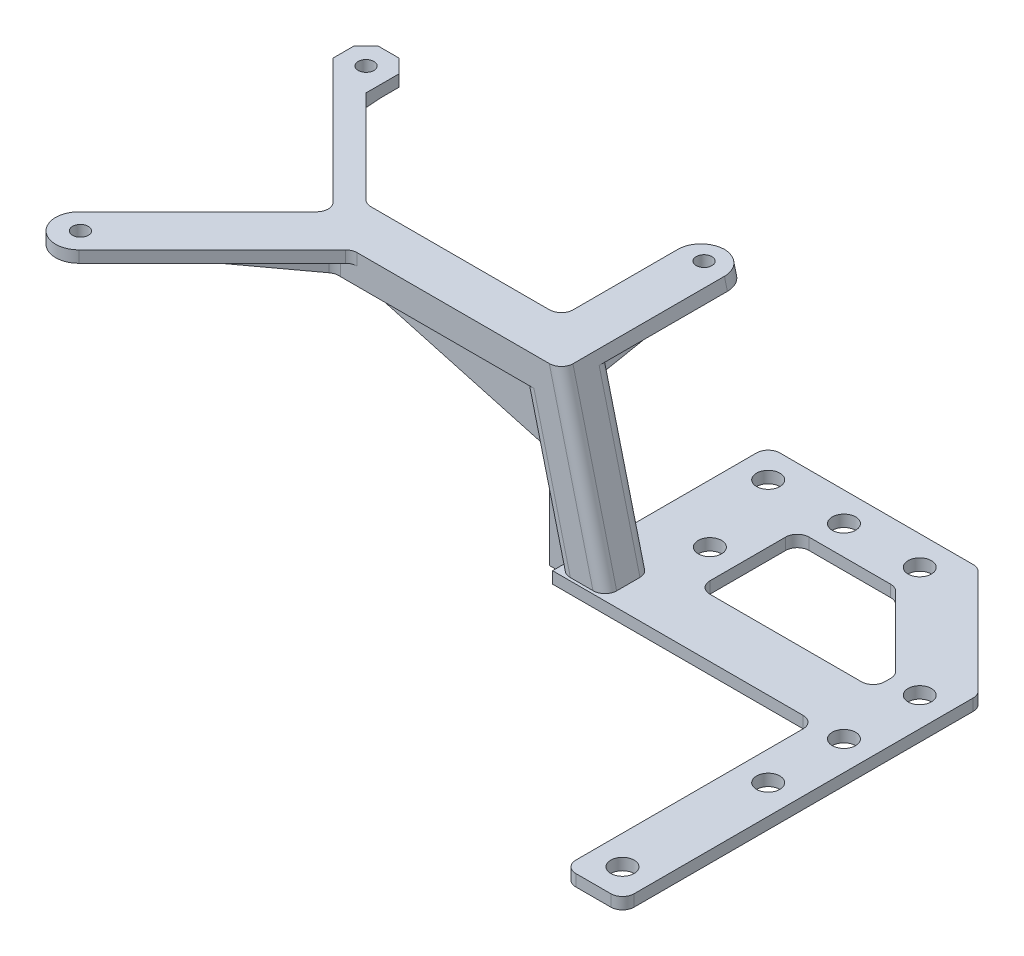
ISO-10303-21;
HEADER;
FILE_DESCRIPTION(('STEP AP214'),'2;1');
FILE_NAME('part.step','',(''),(''),'','','');
FILE_SCHEMA(('AUTOMOTIVE_DESIGN { 1 0 10303 214 1 1 1 1 }'));
ENDSEC;
DATA;
#1=APPLICATION_CONTEXT('core data for automotive mechanical design processes');
#2=APPLICATION_PROTOCOL_DEFINITION('international standard','automotive_design',2000,#1);
#3=PRODUCT_CONTEXT('',#1,'mechanical');
#4=PRODUCT('Part','Part','',(#3));
#5=PRODUCT_RELATED_PRODUCT_CATEGORY('part','',(#4));
#6=PRODUCT_DEFINITION_FORMATION('','',#4);
#7=PRODUCT_DEFINITION_CONTEXT('part definition',#1,'design');
#8=PRODUCT_DEFINITION('design','',#6,#7);
#9=PRODUCT_DEFINITION_SHAPE('','',#8);
#10=(LENGTH_UNIT() NAMED_UNIT(*) SI_UNIT(.MILLI.,.METRE.));
#11=(NAMED_UNIT(*) PLANE_ANGLE_UNIT() SI_UNIT($,.RADIAN.));
#12=(NAMED_UNIT(*) SI_UNIT($,.STERADIAN.) SOLID_ANGLE_UNIT());
#13=UNCERTAINTY_MEASURE_WITH_UNIT(LENGTH_MEASURE(1.E-05),#10,'distance_accuracy_value','');
#14=(GEOMETRIC_REPRESENTATION_CONTEXT(3) GLOBAL_UNCERTAINTY_ASSIGNED_CONTEXT((#13)) GLOBAL_UNIT_ASSIGNED_CONTEXT((#10,
#11,#12)) REPRESENTATION_CONTEXT('',''));
#15=CARTESIAN_POINT('',(0.,0.,0.));
#16=DIRECTION('',(0.,0.,1.));
#17=DIRECTION('',(1.,0.,0.));
#18=AXIS2_PLACEMENT_3D('',#15,#16,#17);
#19=CARTESIAN_POINT('',(-46.1176470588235,-11.5294117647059,0.));
#20=DIRECTION('',(-0.970142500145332,-0.242535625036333,0.));
#21=DIRECTION('',(0.242535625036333,-0.970142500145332,0.));
#22=AXIS2_PLACEMENT_3D('',#19,#20,#21);
#23=PLANE('',#22);
#24=DIRECTION('',(0.,0.,-1.));
#25=VECTOR('',#24,1.);
#26=CARTESIAN_POINT('',(-53.3246437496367,17.2985749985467,0.));
#27=LINE('',#26,#25);
#28=CARTESIAN_POINT('',(-53.3246437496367,17.2985749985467,-15.5));
#29=VERTEX_POINT('',#28);
#30=CARTESIAN_POINT('',(-53.3246437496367,17.2985749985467,-19.5));
#31=VERTEX_POINT('',#30);
#32=EDGE_CURVE('E1049',#29,#31,#27,.T.);
#33=ORIENTED_EDGE('',*,*,#32,.T.);
#34=DIRECTION('',(-0.242535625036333,0.970142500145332,0.));
#35=VECTOR('',#34,1.);
#36=CARTESIAN_POINT('',(-46.1176470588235,-11.5294117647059,-19.5));
#37=LINE('',#36,#35);
#38=CARTESIAN_POINT('',(-53.,15.9999999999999,-19.5));
#39=VERTEX_POINT('',#38);
#40=EDGE_CURVE('E1050',#31,#39,#37,.F.);
#41=ORIENTED_EDGE('',*,*,#40,.T.);
#42=DIRECTION('',(0.,0.,1.));
#43=VECTOR('',#42,1.);
#44=CARTESIAN_POINT('',(-53.,15.9999999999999,0.));
#45=LINE('',#44,#43);
#46=CARTESIAN_POINT('',(-53.,15.9999999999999,-15.5));
#47=VERTEX_POINT('',#46);
#48=EDGE_CURVE('E509',#39,#47,#45,.T.);
#49=ORIENTED_EDGE('',*,*,#48,.T.);
#50=DIRECTION('',(-0.242535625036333,0.970142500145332,0.));
#51=VECTOR('',#50,1.);
#52=CARTESIAN_POINT('',(-55.75,27.,-15.5));
#53=LINE('',#52,#51);
#54=EDGE_CURVE('E1053',#47,#29,#53,.T.);
#55=ORIENTED_EDGE('',*,*,#54,.T.);
#56=EDGE_LOOP('',(#33,#41,#49,#55));
#57=FACE_BOUND('',#56,.T.);
#58=ADVANCED_FACE('F49',(#57),#23,.T.);
#59=DIRECTION('',(0.,0.,1.));
#60=VECTOR('',#59,1.);
#61=CARTESIAN_POINT('',(-56.5,30.,0.));
#62=LINE('',#61,#60);
#63=CARTESIAN_POINT('',(-56.5,30.,-41.5));
#64=VERTEX_POINT('',#63);
#65=CARTESIAN_POINT('',(-56.5,30.,-23.5));
#66=VERTEX_POINT('',#65);
#67=EDGE_CURVE('E582',#64,#66,#62,.T.);
#68=ORIENTED_EDGE('',*,*,#67,.T.);
#69=DIRECTION('',(-0.242535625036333,0.970142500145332,0.));
#70=VECTOR('',#69,1.);
#71=CARTESIAN_POINT('',(-57.,32.,-23.5));
#72=LINE('',#71,#70);
#73=CARTESIAN_POINT('',(-57.,32.,-23.5));
#74=VERTEX_POINT('',#73);
#75=EDGE_CURVE('E777',#66,#74,#72,.T.);
#76=ORIENTED_EDGE('',*,*,#75,.T.);
#77=DIRECTION('',(0.,0.,1.));
#78=VECTOR('',#77,1.);
#79=CARTESIAN_POINT('',(-57.,32.,-45.5));
#80=LINE('',#79,#78);
#81=CARTESIAN_POINT('',(-57.,32.,-41.5));
#82=VERTEX_POINT('',#81);
#83=EDGE_CURVE('E1419',#82,#74,#80,.T.);
#84=ORIENTED_EDGE('',*,*,#83,.F.);
#85=DIRECTION('',(-0.242535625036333,0.970142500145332,0.));
#86=VECTOR('',#85,1.);
#87=CARTESIAN_POINT('',(-46.1176470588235,-11.5294117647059,-41.5));
#88=LINE('',#87,#86);
#89=EDGE_CURVE('E1441',#82,#64,#88,.F.);
#90=ORIENTED_EDGE('',*,*,#89,.T.);
#91=EDGE_LOOP('',(#68,#76,#84,#90));
#92=FACE_BOUND('',#91,.T.);
#93=ADVANCED_FACE('F1040',(#92),#23,.T.);
#94=CARTESIAN_POINT('',(-38.5882352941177,-9.64705882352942,0.));
#95=DIRECTION('',(-0.970142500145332,-0.242535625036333,0.));
#96=DIRECTION('',(0.242535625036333,-0.970142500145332,0.));
#97=AXIS2_PLACEMENT_3D('',#94,#95,#96);
#98=PLANE('',#97);
#99=DIRECTION('',(0.,0.,-1.));
#100=VECTOR('',#99,1.);
#101=CARTESIAN_POINT('',(-49.,32.,-13.5));
#102=LINE('',#101,#100);
#103=CARTESIAN_POINT('',(-49.,32.,-15.5));
#104=VERTEX_POINT('',#103);
#105=CARTESIAN_POINT('',(-49.,32.,-21.5));
#106=VERTEX_POINT('',#105);
#107=EDGE_CURVE('E53',#104,#106,#102,.T.);
#108=ORIENTED_EDGE('',*,*,#107,.F.);
#109=DIRECTION('',(-0.242535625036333,0.970142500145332,0.));
#110=VECTOR('',#109,1.);
#111=CARTESIAN_POINT('',(-38.5882352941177,-9.64705882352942,-15.5));
#112=LINE('',#111,#110);
#113=CARTESIAN_POINT('',(-41.5,2.,-15.5));
#114=VERTEX_POINT('',#113);
#115=EDGE_CURVE('E1068',#104,#114,#112,.F.);
#116=ORIENTED_EDGE('',*,*,#115,.T.);
#117=DIRECTION('',(0.,0.,1.));
#118=VECTOR('',#117,1.);
#119=CARTESIAN_POINT('',(-41.5,2.,0.));
#120=LINE('',#119,#118);
#121=CARTESIAN_POINT('',(-41.5,2.,-19.5));
#122=VERTEX_POINT('',#121);
#123=EDGE_CURVE('E1342',#122,#114,#120,.T.);
#124=ORIENTED_EDGE('',*,*,#123,.F.);
#125=DIRECTION('',(-0.242535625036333,0.970142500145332,0.));
#126=VECTOR('',#125,1.);
#127=CARTESIAN_POINT('',(-48.5,30.,-19.5));
#128=LINE('',#127,#126);
#129=CARTESIAN_POINT('',(-48.5,30.,-19.5));
#130=VERTEX_POINT('',#129);
#131=EDGE_CURVE('E1602',#122,#130,#128,.T.);
#132=ORIENTED_EDGE('',*,*,#131,.T.);
#133=DIRECTION('',(0.,0.,1.));
#134=VECTOR('',#133,1.);
#135=CARTESIAN_POINT('',(-48.5,30.,0.));
#136=LINE('',#135,#134);
#137=CARTESIAN_POINT('',(-48.5,30.,-41.5));
#138=VERTEX_POINT('',#137);
#139=EDGE_CURVE('E579',#138,#130,#136,.T.);
#140=ORIENTED_EDGE('',*,*,#139,.F.);
#141=DIRECTION('',(0.242535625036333,-0.970142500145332,0.));
#142=VECTOR('',#141,1.);
#143=CARTESIAN_POINT('',(-49.,32.,-41.5));
#144=LINE('',#143,#142);
#145=CARTESIAN_POINT('',(-49.,32.,-41.5));
#146=VERTEX_POINT('',#145);
#147=EDGE_CURVE('E1425',#138,#146,#144,.F.);
#148=ORIENTED_EDGE('',*,*,#147,.T.);
#149=DIRECTION('',(0.,0.,1.));
#150=VECTOR('',#149,1.);
#151=CARTESIAN_POINT('',(-49.,32.,-45.5));
#152=LINE('',#151,#150);
#153=EDGE_CURVE('E1424',#146,#106,#152,.T.);
#154=ORIENTED_EDGE('',*,*,#153,.T.);
#155=EDGE_LOOP('',(#108,#116,#124,#132,#140,#148,#154));
#156=FACE_BOUND('',#155,.T.);
#157=ADVANCED_FACE('F1045',(#156),#98,.F.);
#158=CARTESIAN_POINT('',(-60.,27.3030457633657,-21.5));
#159=DIRECTION('',(0.,-0.988714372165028,-0.149812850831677));
#160=DIRECTION('',(0.,0.149812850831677,-0.988714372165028));
#161=AXIS2_PLACEMENT_3D('',#158,#159,#160);
#162=PLANE('',#161);
#163=DIRECTION('',(1.,0.,0.));
#164=VECTOR('',#163,1.);
#165=CARTESIAN_POINT('',(-60.,29.8031733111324,-38.));
#166=LINE('',#165,#164);
#167=CARTESIAN_POINT('',(-54.4507933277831,29.8031733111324,-38.));
#168=VERTEX_POINT('',#167);
#169=CARTESIAN_POINT('',(-50.4507933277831,29.8031733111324,-38.));
#170=VERTEX_POINT('',#169);
#171=EDGE_CURVE('E568',#168,#170,#166,.T.);
#172=ORIENTED_EDGE('',*,*,#171,.T.);
#173=DIRECTION('',(0.0374269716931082,-0.149707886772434,0.988021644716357));
#174=VECTOR('',#173,1.);
#175=CARTESIAN_POINT('',(-49.8400132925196,27.3600531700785,-21.8762296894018));
#176=LINE('',#175,#174);
#177=CARTESIAN_POINT('',(-49.8257276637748,27.3029106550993,-21.499108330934));
#178=VERTEX_POINT('',#177);
#179=EDGE_CURVE('E67',#170,#178,#176,.T.);
#180=ORIENTED_EDGE('',*,*,#179,.T.);
#181=CARTESIAN_POINT('',(-49.8115528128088,27.,-19.5));
#182=DIRECTION('',(0.,-0.988714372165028,-0.149812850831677));
#183=DIRECTION('',(0.857776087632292,-0.0770073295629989,0.508222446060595));
#184=AXIS2_PLACEMENT_3D('',#181,#182,#183);
#185=ELLIPSE('',#184,2.08508429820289,2.);
#186=CARTESIAN_POINT('',(-49.8873142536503,27.3030457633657,-21.5));
#187=VERTEX_POINT('',#186);
#188=EDGE_CURVE('E1222',#178,#187,#185,.F.);
#189=ORIENTED_EDGE('',*,*,#188,.T.);
#190=DIRECTION('',(1.,0.,0.));
#191=VECTOR('',#190,1.);
#192=CARTESIAN_POINT('',(-60.,27.3030457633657,-21.5));
#193=LINE('',#192,#191);
#194=CARTESIAN_POINT('',(-53.8257614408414,27.3030457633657,-21.5));
#195=VERTEX_POINT('',#194);
#196=EDGE_CURVE('E571',#195,#187,#193,.T.);
#197=ORIENTED_EDGE('',*,*,#196,.F.);
#198=DIRECTION('',(-0.0374269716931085,0.149707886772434,-0.988021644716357));
#199=VECTOR('',#198,1.);
#200=CARTESIAN_POINT('',(-53.8344101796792,27.3376407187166,-21.7283150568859));
#201=LINE('',#200,#199);
#202=EDGE_CURVE('E554',#195,#168,#201,.T.);
#203=ORIENTED_EDGE('',*,*,#202,.T.);
#204=EDGE_LOOP('',(#172,#180,#189,#197,#203));
#205=FACE_BOUND('',#204,.T.);
#206=ADVANCED_FACE('F1490',(#205),#162,.T.);
#207=CARTESIAN_POINT('',(-60.,29.8031733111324,-38.));
#208=DIRECTION('',(0.,-0.996490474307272,-0.0837062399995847));
#209=DIRECTION('',(0.,0.0837062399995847,-0.996490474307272));
#210=AXIS2_PLACEMENT_3D('',#207,#208,#209);
#211=PLANE('',#210);
#212=DIRECTION('',(1.,0.,0.));
#213=VECTOR('',#212,1.);
#214=CARTESIAN_POINT('',(-60.,30.,-40.3431457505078));
#215=LINE('',#214,#213);
#216=CARTESIAN_POINT('',(-54.5,30.,-40.3431457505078));
#217=VERTEX_POINT('',#216);
#218=CARTESIAN_POINT('',(-50.5,30.,-40.3431457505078));
#219=VERTEX_POINT('',#218);
#220=EDGE_CURVE('E564',#217,#219,#215,.T.);
#221=ORIENTED_EDGE('',*,*,#220,.T.);
#222=DIRECTION('',(0.0209219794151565,-0.0836879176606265,0.996272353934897));
#223=VECTOR('',#222,1.);
#224=CARTESIAN_POINT('',(-50.4549732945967,29.8198931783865,-38.1990435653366));
#225=LINE('',#224,#223);
#226=EDGE_CURVE('E558',#219,#170,#225,.T.);
#227=ORIENTED_EDGE('',*,*,#226,.T.);
#228=ORIENTED_EDGE('',*,*,#171,.F.);
#229=DIRECTION('',(-0.0209219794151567,0.0836879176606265,-0.996272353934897));
#230=VECTOR('',#229,1.);
#231=CARTESIAN_POINT('',(-54.4532223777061,29.8128895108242,-38.1156676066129));
#232=LINE('',#231,#230);
#233=EDGE_CURVE('E543',#168,#217,#232,.T.);
#234=ORIENTED_EDGE('',*,*,#233,.T.);
#235=EDGE_LOOP('',(#221,#227,#228,#234));
#236=FACE_BOUND('',#235,.T.);
#237=ADVANCED_FACE('F2271',(#236),#211,.T.);
#238=CARTESIAN_POINT('',(-53.,8.,-42.));
#239=DIRECTION('',(0.,1.,0.));
#240=DIRECTION('',(0.,0.,1.));
#241=AXIS2_PLACEMENT_3D('',#238,#239,#240);
#242=CYLINDRICAL_SURFACE('',#241,1.35);
#243=CARTESIAN_POINT('',(-53.,32.,-42.));
#244=DIRECTION('',(0.,1.,0.));
#245=DIRECTION('',(0.,0.,1.));
#246=AXIS2_PLACEMENT_3D('',#243,#244,#245);
#247=CIRCLE('',#246,1.35);
#248=CARTESIAN_POINT('',(-53.,32.,-40.65));
#249=VERTEX_POINT('',#248);
#250=EDGE_CURVE('E1479',#249,#249,#247,.T.);
#251=ORIENTED_EDGE('',*,*,#250,.T.);
#252=EDGE_LOOP('',(#251));
#253=FACE_BOUND('',#252,.T.);
#254=CARTESIAN_POINT('',(-53.,30.,-42.));
#255=DIRECTION('',(0.,-1.,0.));
#256=DIRECTION('',(0.,0.,-1.));
#257=AXIS2_PLACEMENT_3D('',#254,#255,#256);
#258=CIRCLE('',#257,1.35);
#259=CARTESIAN_POINT('',(-53.,30.,-43.35));
#260=VERTEX_POINT('',#259);
#261=EDGE_CURVE('E586',#260,#260,#258,.F.);
#262=ORIENTED_EDGE('',*,*,#261,.F.);
#263=EDGE_LOOP('',(#262));
#264=FACE_BOUND('',#263,.T.);
#265=ADVANCED_FACE('F945',(#253,#264),#242,.F.);
#266=CARTESIAN_POINT('',(-42.2370770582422,-10.5592692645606,-41.5));
#267=DIRECTION('',(-0.242535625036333,0.970142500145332,0.));
#268=DIRECTION('',(-0.970142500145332,-0.242535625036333,0.));
#269=AXIS2_PLACEMENT_3D('',#266,#267,#268);
#270=CYLINDRICAL_SURFACE('',#269,4.);
#271=DIRECTION('',(-0.242535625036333,0.970142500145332,0.));
#272=VECTOR('',#271,1.);
#273=CARTESIAN_POINT('',(-52.4890263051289,29.9561052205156,-45.498216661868));
#274=LINE('',#273,#272);
#275=CARTESIAN_POINT('',(-52.5,30.,-45.498216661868));
#276=VERTEX_POINT('',#275);
#277=CARTESIAN_POINT('',(-52.9999999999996,32.,-45.498216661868));
#278=VERTEX_POINT('',#277);
#279=EDGE_CURVE('E596',#276,#278,#274,.T.);
#280=ORIENTED_EDGE('',*,*,#279,.F.);
#281=CARTESIAN_POINT('',(-52.3768943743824,30.,-41.5));
#282=DIRECTION('',(0.,-1.,0.));
#283=DIRECTION('',(-1.,0.,0.));
#284=AXIS2_PLACEMENT_3D('',#281,#282,#283);
#285=ELLIPSE('',#284,4.12310562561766,4.);
#286=EDGE_CURVE('E575',#276,#64,#285,.F.);
#287=ORIENTED_EDGE('',*,*,#286,.T.);
#288=ORIENTED_EDGE('',*,*,#89,.F.);
#289=CARTESIAN_POINT('',(-52.8768943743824,32.,-41.5));
#290=DIRECTION('',(0.,-1.,0.));
#291=DIRECTION('',(-1.,0.,0.));
#292=AXIS2_PLACEMENT_3D('',#289,#290,#291);
#293=ELLIPSE('',#292,4.12310562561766,4.);
#294=EDGE_CURVE('E1434',#278,#82,#293,.F.);
#295=ORIENTED_EDGE('',*,*,#294,.F.);
#296=EDGE_LOOP('',(#280,#287,#288,#295));
#297=FACE_BOUND('',#296,.T.);
#298=ADVANCED_FACE('F941',(#297),#270,.T.);
#299=CARTESIAN_POINT('',(-42.468805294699,-10.6172013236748,-41.5));
#300=DIRECTION('',(-0.242535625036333,0.970142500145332,0.));
#301=DIRECTION('',(-0.970142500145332,-0.242535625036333,0.));
#302=AXIS2_PLACEMENT_3D('',#299,#300,#301);
#303=CYLINDRICAL_SURFACE('',#302,4.);
#304=ORIENTED_EDGE('',*,*,#147,.F.);
#305=CARTESIAN_POINT('',(-52.6231056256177,30.,-41.5));
#306=DIRECTION('',(0.,-1.,0.));
#307=DIRECTION('',(-1.,0.,0.));
#308=AXIS2_PLACEMENT_3D('',#305,#306,#307);
#309=ELLIPSE('',#308,4.12310562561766,4.);
#310=EDGE_CURVE('E1459',#138,#276,#309,.F.);
#311=ORIENTED_EDGE('',*,*,#310,.T.);
#312=ORIENTED_EDGE('',*,*,#279,.T.);
#313=CARTESIAN_POINT('',(-53.1231056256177,32.,-41.5));
#314=DIRECTION('',(0.,-1.,0.));
#315=DIRECTION('',(-1.,0.,0.));
#316=AXIS2_PLACEMENT_3D('',#313,#314,#315);
#317=ELLIPSE('',#316,4.12310562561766,4.);
#318=EDGE_CURVE('E1437',#146,#278,#317,.F.);
#319=ORIENTED_EDGE('',*,*,#318,.F.);
#320=EDGE_LOOP('',(#304,#311,#312,#319));
#321=FACE_BOUND('',#320,.T.);
#322=ADVANCED_FACE('F937',(#321),#303,.T.);
#323=CARTESIAN_POINT('',(-100.,27.,0.));
#324=DIRECTION('',(0.,-1.,0.));
#325=DIRECTION('',(0.,0.,-1.));
#326=AXIS2_PLACEMENT_3D('',#323,#324,#325);
#327=PLANE('',#326);
#328=DIRECTION('',(-0.707106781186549,0.,0.707106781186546));
#329=VECTOR('',#328,1.);
#330=CARTESIAN_POINT('',(-61.5417068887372,27.,-46.4582931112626));
#331=LINE('',#330,#329);
#332=CARTESIAN_POINT('',(-87.0857864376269,27.,-20.9142135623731));
#333=VERTEX_POINT('',#332);
#334=CARTESIAN_POINT('',(-88.5,27.,-19.5));
#335=VERTEX_POINT('',#334);
#336=EDGE_CURVE('E614',#333,#335,#331,.T.);
#337=ORIENTED_EDGE('',*,*,#336,.F.);
#338=DIRECTION('',(-0.707106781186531,0.,-0.707106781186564));
#339=VECTOR('',#338,1.);
#340=CARTESIAN_POINT('',(-87.0857864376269,27.,-20.9142135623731));
#341=LINE('',#340,#339);
#342=CARTESIAN_POINT('',(-87.6715728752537,27.,-21.5));
#343=VERTEX_POINT('',#342);
#344=EDGE_CURVE('E600',#333,#343,#341,.T.);
#345=ORIENTED_EDGE('',*,*,#344,.T.);
#346=DIRECTION('',(1.,0.,0.));
#347=VECTOR('',#346,1.);
#348=CARTESIAN_POINT('',(-100.,27.,-21.5));
#349=LINE('',#348,#347);
#350=CARTESIAN_POINT('',(-53.6884471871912,27.,-21.5));
#351=VERTEX_POINT('',#350);
#352=EDGE_CURVE('E764',#343,#351,#349,.T.);
#353=ORIENTED_EDGE('',*,*,#352,.T.);
#354=CARTESIAN_POINT('',(-53.6884471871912,27.,-19.5));
#355=DIRECTION('',(0.,-1.,0.));
#356=DIRECTION('',(-1.,0.,0.));
#357=AXIS2_PLACEMENT_3D('',#354,#355,#356);
#358=ELLIPSE('',#357,2.06155281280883,2.);
#359=CARTESIAN_POINT('',(-55.75,27.,-19.5));
#360=VERTEX_POINT('',#359);
#361=EDGE_CURVE('E523',#351,#360,#358,.F.);
#362=ORIENTED_EDGE('',*,*,#361,.T.);
#363=DIRECTION('',(1.,0.,0.));
#364=VECTOR('',#363,1.);
#365=CARTESIAN_POINT('',(-100.,27.,-19.5));
#366=LINE('',#365,#364);
#367=EDGE_CURVE('E753',#335,#360,#366,.T.);
#368=ORIENTED_EDGE('',*,*,#367,.F.);
#369=EDGE_LOOP('',(#337,#345,#353,#362,#368));
#370=FACE_BOUND('',#369,.T.);
#371=ADVANCED_FACE('F940',(#370),#327,.T.);
#372=DIRECTION('',(0.707106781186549,0.,0.707106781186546));
#373=VECTOR('',#372,1.);
#374=CARTESIAN_POINT('',(-115.458293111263,27.,-42.4582931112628));
#375=LINE('',#374,#373);
#376=CARTESIAN_POINT('',(-90.1822558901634,27.,-17.1822558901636));
#377=VERTEX_POINT('',#376);
#378=CARTESIAN_POINT('',(-88.5000000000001,27.,-15.5000000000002));
#379=VERTEX_POINT('',#378);
#380=EDGE_CURVE('E653',#377,#379,#375,.T.);
#381=ORIENTED_EDGE('',*,*,#380,.F.);
#382=CARTESIAN_POINT('',(-92.1568542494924,27.,-17.5));
#383=DIRECTION('',(0.,-1.,0.));
#384=DIRECTION('',(0.,0.,-1.));
#385=AXIS2_PLACEMENT_3D('',#382,#383,#384);
#386=CIRCLE('',#385,2.);
#387=CARTESIAN_POINT('',(-90.1822558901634,27.,-17.8177441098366));
#388=VERTEX_POINT('',#387);
#389=EDGE_CURVE('E1194',#377,#388,#386,.F.);
#390=ORIENTED_EDGE('',*,*,#389,.T.);
#391=EDGE_CURVE('E620',#335,#388,#331,.T.);
#392=ORIENTED_EDGE('',*,*,#391,.F.);
#393=DIRECTION('',(0.,0.,1.));
#394=VECTOR('',#393,1.);
#395=CARTESIAN_POINT('',(-88.5,27.,-57.920369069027));
#396=LINE('',#395,#394);
#397=EDGE_CURVE('E754',#335,#379,#396,.T.);
#398=ORIENTED_EDGE('',*,*,#397,.T.);
#399=EDGE_LOOP('',(#381,#390,#392,#398));
#400=FACE_BOUND('',#399,.T.);
#401=ADVANCED_FACE('F846',(#400),#327,.T.);
#402=CARTESIAN_POINT('',(0.,32.,0.));
#403=DIRECTION('',(0.,-1.,0.));
#404=DIRECTION('',(0.,0.,-1.));
#405=AXIS2_PLACEMENT_3D('',#402,#403,#404);
#406=PLANE('',#405);
#407=ORIENTED_EDGE('',*,*,#250,.F.);
#408=EDGE_LOOP('',(#407));
#409=FACE_BOUND('',#408,.T.);
#410=CARTESIAN_POINT('',(-111.,32.,-42.));
#411=DIRECTION('',(0.,1.,0.));
#412=DIRECTION('',(0.,0.,1.));
#413=AXIS2_PLACEMENT_3D('',#410,#411,#412);
#414=CIRCLE('',#413,1.35000000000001);
#415=CARTESIAN_POINT('',(-111.,32.,-40.65));
#416=VERTEX_POINT('',#415);
#417=EDGE_CURVE('E692',#416,#416,#414,.T.);
#418=ORIENTED_EDGE('',*,*,#417,.F.);
#419=EDGE_LOOP('',(#418));
#420=FACE_BOUND('',#419,.T.);
#421=CARTESIAN_POINT('',(-111.,32.,7.00000000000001));
#422=DIRECTION('',(0.,1.,0.));
#423=DIRECTION('',(0.,0.,1.));
#424=AXIS2_PLACEMENT_3D('',#421,#422,#423);
#425=CIRCLE('',#424,1.35000000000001);
#426=CARTESIAN_POINT('',(-111.,32.,8.35000000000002));
#427=VERTEX_POINT('',#426);
#428=EDGE_CURVE('E693',#427,#427,#425,.T.);
#429=ORIENTED_EDGE('',*,*,#428,.F.);
#430=EDGE_LOOP('',(#429));
#431=FACE_BOUND('',#430,.T.);
#432=DIRECTION('',(1.,0.,0.));
#433=VECTOR('',#432,1.);
#434=CARTESIAN_POINT('',(-57.,32.,-13.5));
#435=LINE('',#434,#433);
#436=CARTESIAN_POINT('',(-84.0147186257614,32.,-13.5));
#437=VERTEX_POINT('',#436);
#438=CARTESIAN_POINT('',(-51.0615528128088,32.,-13.5));
#439=VERTEX_POINT('',#438);
#440=EDGE_CURVE('E1469',#437,#439,#435,.T.);
#441=ORIENTED_EDGE('',*,*,#440,.T.);
#442=CARTESIAN_POINT('',(-51.0615528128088,32.,-15.5));
#443=DIRECTION('',(0.,-1.,0.));
#444=DIRECTION('',(-1.,0.,0.));
#445=AXIS2_PLACEMENT_3D('',#442,#443,#444);
#446=ELLIPSE('',#445,2.06155281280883,2.);
#447=EDGE_CURVE('E818',#439,#104,#446,.F.);
#448=ORIENTED_EDGE('',*,*,#447,.T.);
#449=ORIENTED_EDGE('',*,*,#107,.T.);
#450=ORIENTED_EDGE('',*,*,#153,.F.);
#451=ORIENTED_EDGE('',*,*,#318,.T.);
#452=ORIENTED_EDGE('',*,*,#294,.T.);
#453=ORIENTED_EDGE('',*,*,#83,.T.);
#454=CARTESIAN_POINT('',(-59.0615528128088,32.,-23.5));
#455=DIRECTION('',(0.,-1.,0.));
#456=DIRECTION('',(1.,0.,0.));
#457=AXIS2_PLACEMENT_3D('',#454,#455,#456);
#458=ELLIPSE('',#457,2.06155281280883,2.);
#459=CARTESIAN_POINT('',(-59.0615528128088,32.,-21.5));
#460=VERTEX_POINT('',#459);
#461=EDGE_CURVE('E1181',#74,#460,#458,.T.);
#462=ORIENTED_EDGE('',*,*,#461,.T.);
#463=DIRECTION('',(1.,0.,0.));
#464=VECTOR('',#463,1.);
#465=CARTESIAN_POINT('',(-100.,32.,-21.5));
#466=LINE('',#465,#464);
#467=CARTESIAN_POINT('',(-89.6715728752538,32.,-21.5));
#468=VERTEX_POINT('',#467);
#469=EDGE_CURVE('E767',#468,#460,#466,.T.);
#470=ORIENTED_EDGE('',*,*,#469,.F.);
#471=CARTESIAN_POINT('',(-89.6715728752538,32.,-23.5));
#472=DIRECTION('',(0.,-1.,0.));
#473=DIRECTION('',(0.,0.,-1.));
#474=AXIS2_PLACEMENT_3D('',#471,#472,#473);
#475=CIRCLE('',#474,2.);
#476=CARTESIAN_POINT('',(-91.0857864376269,32.,-22.0857864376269));
#477=VERTEX_POINT('',#476);
#478=EDGE_CURVE('E1207',#468,#477,#475,.T.);
#479=ORIENTED_EDGE('',*,*,#478,.T.);
#480=DIRECTION('',(0.707106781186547,0.,0.707106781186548));
#481=VECTOR('',#480,1.);
#482=CARTESIAN_POINT('',(-34.5000000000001,32.,34.5));
#483=LINE('',#482,#481);
#484=CARTESIAN_POINT('',(-107.,32.,-38.));
#485=VERTEX_POINT('',#484);
#486=EDGE_CURVE('E660',#485,#477,#483,.T.);
#487=ORIENTED_EDGE('',*,*,#486,.F.);
#488=DIRECTION('',(0.,0.,1.));
#489=VECTOR('',#488,1.);
#490=CARTESIAN_POINT('',(-107.,32.,1.85615411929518E-13));
#491=LINE('',#490,#489);
#492=CARTESIAN_POINT('',(-107.,32.,-43.6568542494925));
#493=VERTEX_POINT('',#492);
#494=EDGE_CURVE('E656',#493,#485,#491,.T.);
#495=ORIENTED_EDGE('',*,*,#494,.F.);
#496=DIRECTION('',(-0.707106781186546,0.,-0.707106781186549));
#497=VECTOR('',#496,1.);
#498=CARTESIAN_POINT('',(-75.6191662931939,32.,-12.2760205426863));
#499=LINE('',#498,#497);
#500=CARTESIAN_POINT('',(-109.343145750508,32.,-46.));
#501=VERTEX_POINT('',#500);
#502=EDGE_CURVE('E720',#493,#501,#499,.T.);
#503=ORIENTED_EDGE('',*,*,#502,.T.);
#504=DIRECTION('',(1.,0.,0.));
#505=VECTOR('',#504,1.);
#506=CARTESIAN_POINT('',(0.,32.,-46.));
#507=LINE('',#506,#505);
#508=CARTESIAN_POINT('',(-112.911688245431,32.,-46.));
#509=VERTEX_POINT('',#508);
#510=EDGE_CURVE('E678',#509,#501,#507,.T.);
#511=ORIENTED_EDGE('',*,*,#510,.F.);
#512=DIRECTION('',(0.707106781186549,0.,-0.707106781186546));
#513=VECTOR('',#512,1.);
#514=CARTESIAN_POINT('',(-79.4558441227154,32.,-79.4558441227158));
#515=LINE('',#514,#513);
#516=CARTESIAN_POINT('',(-115.,32.,-43.9116882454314));
#517=VERTEX_POINT('',#516);
#518=EDGE_CURVE('E697',#517,#509,#515,.T.);
#519=ORIENTED_EDGE('',*,*,#518,.F.);
#520=DIRECTION('',(0.,0.,-1.));
#521=VECTOR('',#520,1.);
#522=CARTESIAN_POINT('',(-115.,32.,0.));
#523=LINE('',#522,#521);
#524=CARTESIAN_POINT('',(-115.,32.,-40.3431457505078));
#525=VERTEX_POINT('',#524);
#526=EDGE_CURVE('E672',#525,#517,#523,.T.);
#527=ORIENTED_EDGE('',*,*,#526,.F.);
#528=DIRECTION('',(0.707106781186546,0.,0.707106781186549));
#529=VECTOR('',#528,1.);
#530=CARTESIAN_POINT('',(-116.784271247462,32.,-42.1274169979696));
#531=LINE('',#530,#529);
#532=CARTESIAN_POINT('',(-93.5710678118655,32.,-18.9142135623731));
#533=VERTEX_POINT('',#532);
#534=EDGE_CURVE('E704',#525,#533,#531,.T.);
#535=ORIENTED_EDGE('',*,*,#534,.T.);
#536=CARTESIAN_POINT('',(-94.9852813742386,32.,-17.5000000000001));
#537=DIRECTION('',(0.,-1.,0.));
#538=DIRECTION('',(0.,0.,-1.));
#539=AXIS2_PLACEMENT_3D('',#536,#537,#538);
#540=CIRCLE('',#539,2.);
#541=CARTESIAN_POINT('',(-93.5710678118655,32.,-16.0857864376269));
#542=VERTEX_POINT('',#541);
#543=EDGE_CURVE('E1204',#533,#542,#540,.T.);
#544=ORIENTED_EDGE('',*,*,#543,.T.);
#545=DIRECTION('',(0.707106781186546,0.,-0.707106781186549));
#546=VECTOR('',#545,1.);
#547=CARTESIAN_POINT('',(-116.784271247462,32.,7.12741699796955));
#548=LINE('',#547,#546);
#549=CARTESIAN_POINT('',(-113.955844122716,32.,4.29898987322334));
#550=VERTEX_POINT('',#549);
#551=EDGE_CURVE('E736',#550,#542,#548,.T.);
#552=ORIENTED_EDGE('',*,*,#551,.F.);
#553=CARTESIAN_POINT('',(-111.127416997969,32.,7.12741699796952));
#554=DIRECTION('',(0.,-1.,0.));
#555=DIRECTION('',(0.,0.,-1.));
#556=AXIS2_PLACEMENT_3D('',#553,#554,#555);
#557=CIRCLE('',#556,4.);
#558=CARTESIAN_POINT('',(-113.955844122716,32.,9.95584412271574));
#559=VERTEX_POINT('',#558);
#560=EDGE_CURVE('E1431',#550,#559,#557,.F.);
#561=ORIENTED_EDGE('',*,*,#560,.T.);
#562=CARTESIAN_POINT('',(-111.127416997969,32.,7.12741699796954));
#563=DIRECTION('',(0.,-1.,0.));
#564=DIRECTION('',(0.,0.,-1.));
#565=AXIS2_PLACEMENT_3D('',#562,#563,#564);
#566=CIRCLE('',#565,4.);
#567=CARTESIAN_POINT('',(-108.298989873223,32.,9.95584412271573));
#568=VERTEX_POINT('',#567);
#569=EDGE_CURVE('E1427',#559,#568,#566,.F.);
#570=ORIENTED_EDGE('',*,*,#569,.T.);
#571=DIRECTION('',(-0.707106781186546,0.,0.707106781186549));
#572=VECTOR('',#571,1.);
#573=CARTESIAN_POINT('',(-75.6191662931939,32.,-22.7239794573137));
#574=LINE('',#573,#572);
#575=CARTESIAN_POINT('',(-85.4289321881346,32.,-12.9142135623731));
#576=VERTEX_POINT('',#575);
#577=EDGE_CURVE('E744',#576,#568,#574,.T.);
#578=ORIENTED_EDGE('',*,*,#577,.F.);
#579=CARTESIAN_POINT('',(-84.0147186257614,32.,-11.5));
#580=DIRECTION('',(0.,-1.,0.));
#581=DIRECTION('',(0.,0.,-1.));
#582=AXIS2_PLACEMENT_3D('',#579,#580,#581);
#583=CIRCLE('',#582,2.);
#584=EDGE_CURVE('E1178',#576,#437,#583,.T.);
#585=ORIENTED_EDGE('',*,*,#584,.T.);
#586=EDGE_LOOP('',(#441,#448,#449,#450,#451,#452,#453,#462,#470,#479,#487,#495,#503,#511,#519,
#527,#535,#544,#552,#561,#570,#578,#585));
#587=FACE_BOUND('',#586,.T.);
#588=ADVANCED_FACE('F835',(#409,#420,#431,#587),#406,.F.);
#589=CARTESIAN_POINT('',(-87.0857864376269,27.,-14.0857864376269));
#590=VERTEX_POINT('',#589);
#591=EDGE_CURVE('E649',#379,#590,#375,.T.);
#592=ORIENTED_EDGE('',*,*,#591,.F.);
#593=DIRECTION('',(1.,0.,0.));
#594=VECTOR('',#593,1.);
#595=CARTESIAN_POINT('',(-100.,27.,-15.5));
#596=LINE('',#595,#594);
#597=CARTESIAN_POINT('',(-55.75,27.,-15.5));
#598=VERTEX_POINT('',#597);
#599=EDGE_CURVE('E1554',#379,#598,#596,.T.);
#600=ORIENTED_EDGE('',*,*,#599,.T.);
#601=CARTESIAN_POINT('',(-53.6884471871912,27.,-15.5));
#602=DIRECTION('',(0.,-1.,0.));
#603=DIRECTION('',(1.,0.,0.));
#604=AXIS2_PLACEMENT_3D('',#601,#602,#603);
#605=ELLIPSE('',#604,2.06155281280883,2.);
#606=CARTESIAN_POINT('',(-53.6884471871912,27.,-13.5));
#607=VERTEX_POINT('',#606);
#608=EDGE_CURVE('E522',#598,#607,#605,.F.);
#609=ORIENTED_EDGE('',*,*,#608,.T.);
#610=DIRECTION('',(1.,0.,0.));
#611=VECTOR('',#610,1.);
#612=CARTESIAN_POINT('',(-100.,27.,-13.5));
#613=LINE('',#612,#611);
#614=CARTESIAN_POINT('',(-87.6715728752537,27.,-13.5));
#615=VERTEX_POINT('',#614);
#616=EDGE_CURVE('E770',#615,#607,#613,.T.);
#617=ORIENTED_EDGE('',*,*,#616,.F.);
#618=DIRECTION('',(0.707106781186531,0.,-0.707106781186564));
#619=VECTOR('',#618,1.);
#620=CARTESIAN_POINT('',(-87.0857864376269,27.,-14.0857864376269));
#621=LINE('',#620,#619);
#622=EDGE_CURVE('E591',#615,#590,#621,.T.);
#623=ORIENTED_EDGE('',*,*,#622,.T.);
#624=EDGE_LOOP('',(#592,#600,#609,#617,#623));
#625=FACE_BOUND('',#624,.T.);
#626=ADVANCED_FACE('F845',(#625),#327,.T.);
#627=CARTESIAN_POINT('',(0.,0.,-13.5));
#628=DIRECTION('',(0.,0.,-1.));
#629=DIRECTION('',(-1.,0.,0.));
#630=AXIS2_PLACEMENT_3D('',#627,#628,#629);
#631=PLANE('',#630);
#632=ORIENTED_EDGE('',*,*,#440,.F.);
#633=DIRECTION('',(0.,-1.,0.));
#634=VECTOR('',#633,1.);
#635=CARTESIAN_POINT('',(-84.0147186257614,30.,-13.5));
#636=LINE('',#635,#634);
#637=CARTESIAN_POINT('',(-84.0147186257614,30.,-13.5));
#638=VERTEX_POINT('',#637);
#639=EDGE_CURVE('E1590',#437,#638,#636,.T.);
#640=ORIENTED_EDGE('',*,*,#639,.T.);
#641=DIRECTION('',(1.,0.,0.));
#642=VECTOR('',#641,1.);
#643=CARTESIAN_POINT('',(-26.44759341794,30.,-13.5));
#644=LINE('',#643,#642);
#645=CARTESIAN_POINT('',(-86.8431457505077,30.,-13.5));
#646=VERTEX_POINT('',#645);
#647=EDGE_CURVE('E740',#646,#638,#644,.T.);
#648=ORIENTED_EDGE('',*,*,#647,.F.);
#649=DIRECTION('',(0.,-1.,0.));
#650=VECTOR('',#649,1.);
#651=CARTESIAN_POINT('',(-86.8431457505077,0.,-13.5));
#652=LINE('',#651,#650);
#653=CARTESIAN_POINT('',(-86.8431457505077,27.0259972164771,-13.5));
#654=VERTEX_POINT('',#653);
#655=EDGE_CURVE('E1584',#646,#654,#652,.T.);
#656=ORIENTED_EDGE('',*,*,#655,.T.);
#657=DIRECTION('',(-0.997142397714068,0.0755449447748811,0.));
#658=VECTOR('',#657,1.);
#659=CARTESIAN_POINT('',(-115.29302701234,29.1814012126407,-13.5));
#660=LINE('',#659,#658);
#661=CARTESIAN_POINT('',(-87.6715728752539,27.08876004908,-13.5));
#662=VERTEX_POINT('',#661);
#663=EDGE_CURVE('E1581',#654,#662,#660,.T.);
#664=ORIENTED_EDGE('',*,*,#663,.T.);
#665=DIRECTION('',(0.,-1.,0.));
#666=VECTOR('',#665,1.);
#667=CARTESIAN_POINT('',(-87.6715728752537,31.3098582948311,-13.5));
#668=LINE('',#667,#666);
#669=EDGE_CURVE('E595',#662,#615,#668,.T.);
#670=ORIENTED_EDGE('',*,*,#669,.T.);
#671=ORIENTED_EDGE('',*,*,#616,.T.);
#672=DIRECTION('',(-0.242535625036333,0.970142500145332,0.));
#673=VECTOR('',#672,1.);
#674=CARTESIAN_POINT('',(-47.5597149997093,2.48507125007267,-13.5));
#675=LINE('',#674,#673);
#676=CARTESIAN_POINT('',(-47.4384471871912,2.,-13.5));
#677=VERTEX_POINT('',#676);
#678=EDGE_CURVE('E1468',#607,#677,#675,.F.);
#679=ORIENTED_EDGE('',*,*,#678,.T.);
#680=DIRECTION('',(-1.,0.,0.));
#681=VECTOR('',#680,1.);
#682=CARTESIAN_POINT('',(0.,2.,-13.5));
#683=LINE('',#682,#681);
#684=CARTESIAN_POINT('',(-43.5615528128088,2.,-13.5));
#685=VERTEX_POINT('',#684);
#686=EDGE_CURVE('E1617',#685,#677,#683,.T.);
#687=ORIENTED_EDGE('',*,*,#686,.F.);
#688=DIRECTION('',(-0.242535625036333,0.970142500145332,0.));
#689=VECTOR('',#688,1.);
#690=CARTESIAN_POINT('',(-40.5285202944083,-10.1321300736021,-13.5));
#691=LINE('',#690,#689);
#692=EDGE_CURVE('E1578',#685,#439,#691,.T.);
#693=ORIENTED_EDGE('',*,*,#692,.T.);
#694=EDGE_LOOP('',(#632,#640,#648,#656,#664,#670,#671,#679,#687,#693));
#695=FACE_BOUND('',#694,.T.);
#696=ADVANCED_FACE('F1493',(#695),#631,.F.);
#697=CARTESIAN_POINT('',(-100.,0.,-19.5));
#698=DIRECTION('',(0.,0.,1.));
#699=DIRECTION('',(1.,0.,0.));
#700=AXIS2_PLACEMENT_3D('',#697,#698,#699);
#701=PLANE('',#700);
#702=DIRECTION('',(-0.242535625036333,0.970142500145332,0.));
#703=VECTOR('',#702,1.);
#704=CARTESIAN_POINT('',(-46.1176470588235,-11.5294117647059,-19.5));
#705=LINE('',#704,#703);
#706=EDGE_CURVE('E1057',#31,#360,#705,.T.);
#707=ORIENTED_EDGE('',*,*,#706,.F.);
#708=DIRECTION('',(0.964007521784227,-0.265874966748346,0.));
#709=VECTOR('',#708,1.);
#710=CARTESIAN_POINT('',(-53.3246437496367,17.2985749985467,-19.5));
#711=LINE('',#710,#709);
#712=EDGE_CURVE('E750',#335,#31,#711,.T.);
#713=ORIENTED_EDGE('',*,*,#712,.F.);
#714=ORIENTED_EDGE('',*,*,#367,.T.);
#715=EDGE_LOOP('',(#707,#713,#714));
#716=FACE_BOUND('',#715,.T.);
#717=ADVANCED_FACE('F1495',(#716),#701,.F.);
#718=CARTESIAN_POINT('',(-50.,2.,0.));
#719=DIRECTION('',(-1.,0.,0.));
#720=DIRECTION('',(0.,0.,1.));
#721=AXIS2_PLACEMENT_3D('',#718,#719,#720);
#722=PLANE('',#721);
#723=DIRECTION('',(0.,0.,-1.));
#724=VECTOR('',#723,1.);
#725=CARTESIAN_POINT('',(-50.,2.,0.));
#726=LINE('',#725,#724);
#727=CARTESIAN_POINT('',(-50.,2.,-19.5));
#728=VERTEX_POINT('',#727);
#729=CARTESIAN_POINT('',(-50.,2.,-48.));
#730=VERTEX_POINT('',#729);
#731=EDGE_CURVE('E529',#728,#730,#726,.T.);
#732=ORIENTED_EDGE('',*,*,#731,.T.);
#733=DIRECTION('',(0.,-1.,0.));
#734=VECTOR('',#733,1.);
#735=CARTESIAN_POINT('',(-50.,2.,-48.));
#736=LINE('',#735,#734);
#737=CARTESIAN_POINT('',(-50.,0.,-48.));
#738=VERTEX_POINT('',#737);
#739=EDGE_CURVE('E1171',#730,#738,#736,.T.);
#740=ORIENTED_EDGE('',*,*,#739,.T.);
#741=DIRECTION('',(0.,0.,-1.));
#742=VECTOR('',#741,1.);
#743=CARTESIAN_POINT('',(-50.,0.,0.));
#744=LINE('',#743,#742);
#745=CARTESIAN_POINT('',(-50.,0.,-19.5));
#746=VERTEX_POINT('',#745);
#747=EDGE_CURVE('E1370',#746,#738,#744,.T.);
#748=ORIENTED_EDGE('',*,*,#747,.F.);
#749=DIRECTION('',(0.,-1.,0.));
#750=VECTOR('',#749,1.);
#751=CARTESIAN_POINT('',(-50.,0.,-19.5));
#752=LINE('',#751,#750);
#753=EDGE_CURVE('E1551',#728,#746,#752,.T.);
#754=ORIENTED_EDGE('',*,*,#753,.F.);
#755=EDGE_LOOP('',(#732,#740,#748,#754));
#756=FACE_BOUND('',#755,.T.);
#757=ADVANCED_FACE('F906',(#756),#722,.T.);
#758=CARTESIAN_POINT('',(0.,0.,-21.5));
#759=DIRECTION('',(0.,0.,-1.));
#760=DIRECTION('',(-1.,0.,0.));
#761=AXIS2_PLACEMENT_3D('',#758,#759,#760);
#762=PLANE('',#761);
#763=ORIENTED_EDGE('',*,*,#469,.T.);
#764=DIRECTION('',(-0.242535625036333,0.970142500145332,0.));
#765=VECTOR('',#764,1.);
#766=CARTESIAN_POINT('',(-58.4402850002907,29.5149287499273,-21.5));
#767=LINE('',#766,#765);
#768=CARTESIAN_POINT('',(-58.5615528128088,30.,-21.5));
#769=VERTEX_POINT('',#768);
#770=EDGE_CURVE('E788',#460,#769,#767,.F.);
#771=ORIENTED_EDGE('',*,*,#770,.T.);
#772=DIRECTION('',(1.,0.,0.));
#773=VECTOR('',#772,1.);
#774=CARTESIAN_POINT('',(-54.5,30.,-21.5));
#775=LINE('',#774,#773);
#776=CARTESIAN_POINT('',(-54.5,30.,-21.5));
#777=VERTEX_POINT('',#776);
#778=EDGE_CURVE('E537',#769,#777,#775,.T.);
#779=ORIENTED_EDGE('',*,*,#778,.T.);
#780=DIRECTION('',(0.242535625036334,-0.970142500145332,0.));
#781=VECTOR('',#780,1.);
#782=CARTESIAN_POINT('',(-53.8257614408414,27.3030457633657,-21.5));
#783=LINE('',#782,#781);
#784=EDGE_CURVE('E531',#777,#195,#783,.T.);
#785=ORIENTED_EDGE('',*,*,#784,.T.);
#786=ORIENTED_EDGE('',*,*,#196,.T.);
#787=DIRECTION('',(-0.242535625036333,0.970142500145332,0.));
#788=VECTOR('',#787,1.);
#789=CARTESIAN_POINT('',(-43.4402850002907,1.51492874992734,-21.5));
#790=LINE('',#789,#788);
#791=CARTESIAN_POINT('',(-43.5615528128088,2.,-21.5));
#792=VERTEX_POINT('',#791);
#793=EDGE_CURVE('E781',#187,#792,#790,.F.);
#794=ORIENTED_EDGE('',*,*,#793,.T.);
#795=DIRECTION('',(-1.,0.,0.));
#796=VECTOR('',#795,1.);
#797=CARTESIAN_POINT('',(0.,2.,-21.5));
#798=LINE('',#797,#796);
#799=CARTESIAN_POINT('',(-47.4384471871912,2.,-21.5));
#800=VERTEX_POINT('',#799);
#801=EDGE_CURVE('E833',#792,#800,#798,.T.);
#802=ORIENTED_EDGE('',*,*,#801,.T.);
#803=DIRECTION('',(-0.242535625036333,0.970142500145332,0.));
#804=VECTOR('',#803,1.);
#805=CARTESIAN_POINT('',(-44.1773620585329,-11.0443405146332,-21.5));
#806=LINE('',#805,#804);
#807=EDGE_CURVE('E517',#800,#351,#806,.T.);
#808=ORIENTED_EDGE('',*,*,#807,.T.);
#809=ORIENTED_EDGE('',*,*,#352,.F.);
#810=DIRECTION('',(0.,-1.,0.));
#811=VECTOR('',#810,1.);
#812=CARTESIAN_POINT('',(-87.6715728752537,31.3098582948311,-21.5));
#813=LINE('',#812,#811);
#814=CARTESIAN_POINT('',(-87.6715728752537,27.0887600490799,-21.5));
#815=VERTEX_POINT('',#814);
#816=EDGE_CURVE('E604',#815,#343,#813,.T.);
#817=ORIENTED_EDGE('',*,*,#816,.F.);
#818=DIRECTION('',(-0.997142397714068,0.0755449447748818,0.));
#819=VECTOR('',#818,1.);
#820=CARTESIAN_POINT('',(-97.8890701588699,27.86285236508,-21.5));
#821=LINE('',#820,#819);
#822=CARTESIAN_POINT('',(-89.6715728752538,27.2402829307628,-21.5));
#823=VERTEX_POINT('',#822);
#824=EDGE_CURVE('E634',#815,#823,#821,.T.);
#825=ORIENTED_EDGE('',*,*,#824,.T.);
#826=DIRECTION('',(0.,1.,0.));
#827=VECTOR('',#826,1.);
#828=CARTESIAN_POINT('',(-89.6715728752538,0.,-21.5));
#829=LINE('',#828,#827);
#830=EDGE_CURVE('E784',#823,#468,#829,.T.);
#831=ORIENTED_EDGE('',*,*,#830,.T.);
#832=EDGE_LOOP('',(#763,#771,#779,#785,#786,#794,#802,#808,#809,#817,#825,#831));
#833=FACE_BOUND('',#832,.T.);
#834=ADVANCED_FACE('F852',(#833),#762,.T.);
#835=CARTESIAN_POINT('',(0.,2.,0.));
#836=DIRECTION('',(0.,1.,0.));
#837=DIRECTION('',(0.,0.,1.));
#838=AXIS2_PLACEMENT_3D('',#835,#836,#837);
#839=PLANE('',#838);
#840=DIRECTION('',(1.,0.,0.));
#841=VECTOR('',#840,1.);
#842=CARTESIAN_POINT('',(0.,2.,-15.5));
#843=LINE('',#842,#841);
#844=CARTESIAN_POINT('',(-50.,2.,-15.5));
#845=VERTEX_POINT('',#844);
#846=CARTESIAN_POINT('',(-49.5,2.,-15.5));
#847=VERTEX_POINT('',#846);
#848=EDGE_CURVE('E532',#845,#847,#843,.T.);
#849=ORIENTED_EDGE('',*,*,#848,.F.);
#850=CARTESIAN_POINT('',(-50.,2.,-13.));
#851=VERTEX_POINT('',#850);
#852=EDGE_CURVE('E1302',#851,#845,#726,.T.);
#853=ORIENTED_EDGE('',*,*,#852,.F.);
#854=DIRECTION('',(-1.,0.,0.));
#855=VECTOR('',#854,1.);
#856=CARTESIAN_POINT('',(0.,2.,-13.));
#857=LINE('',#856,#855);
#858=CARTESIAN_POINT('',(-7.,2.,-13.));
#859=VERTEX_POINT('',#858);
#860=EDGE_CURVE('E1292',#859,#851,#857,.T.);
#861=ORIENTED_EDGE('',*,*,#860,.F.);
#862=CARTESIAN_POINT('',(-7.,2.,-11.));
#863=DIRECTION('',(0.,1.,0.));
#864=DIRECTION('',(0.,0.,1.));
#865=AXIS2_PLACEMENT_3D('',#862,#863,#864);
#866=CIRCLE('',#865,2.);
#867=CARTESIAN_POINT('',(-5.,2.,-11.));
#868=VERTEX_POINT('',#867);
#869=EDGE_CURVE('E12',#859,#868,#866,.F.);
#870=ORIENTED_EDGE('',*,*,#869,.T.);
#871=DIRECTION('',(0.,0.,-1.));
#872=VECTOR('',#871,1.);
#873=CARTESIAN_POINT('',(-5.,2.,0.));
#874=LINE('',#873,#872);
#875=CARTESIAN_POINT('',(-5.,2.,28.));
#876=VERTEX_POINT('',#875);
#877=EDGE_CURVE('E1289',#876,#868,#874,.T.);
#878=ORIENTED_EDGE('',*,*,#877,.F.);
#879=CARTESIAN_POINT('',(-3.,2.,28.));
#880=DIRECTION('',(0.,1.,0.));
#881=DIRECTION('',(0.,0.,1.));
#882=AXIS2_PLACEMENT_3D('',#879,#880,#881);
#883=CIRCLE('',#882,2.);
#884=CARTESIAN_POINT('',(-3.,2.,30.));
#885=VERTEX_POINT('',#884);
#886=EDGE_CURVE('E1147',#876,#885,#883,.T.);
#887=ORIENTED_EDGE('',*,*,#886,.T.);
#888=DIRECTION('',(-1.,0.,0.));
#889=VECTOR('',#888,1.);
#890=CARTESIAN_POINT('',(0.,2.,30.));
#891=LINE('',#890,#889);
#892=CARTESIAN_POINT('',(3.00000000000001,2.,30.));
#893=VERTEX_POINT('',#892);
#894=EDGE_CURVE('E1295',#893,#885,#891,.T.);
#895=ORIENTED_EDGE('',*,*,#894,.F.);
#896=CARTESIAN_POINT('',(3.00000000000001,2.,28.));
#897=DIRECTION('',(0.,1.,0.));
#898=DIRECTION('',(0.,0.,1.));
#899=AXIS2_PLACEMENT_3D('',#896,#897,#898);
#900=CIRCLE('',#899,2.);
#901=CARTESIAN_POINT('',(5.00000000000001,2.,28.));
#902=VERTEX_POINT('',#901);
#903=EDGE_CURVE('E1144',#893,#902,#900,.T.);
#904=ORIENTED_EDGE('',*,*,#903,.T.);
#905=DIRECTION('',(0.,0.,1.));
#906=VECTOR('',#905,1.);
#907=CARTESIAN_POINT('',(5.00000000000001,2.,0.));
#908=LINE('',#907,#906);
#909=CARTESIAN_POINT('',(5.,2.,-30.1715728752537));
#910=VERTEX_POINT('',#909);
#911=EDGE_CURVE('E1300',#910,#902,#908,.T.);
#912=ORIENTED_EDGE('',*,*,#911,.F.);
#913=CARTESIAN_POINT('',(3.,2.,-30.1715728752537));
#914=DIRECTION('',(0.,1.,0.));
#915=DIRECTION('',(0.,0.,1.));
#916=AXIS2_PLACEMENT_3D('',#913,#914,#915);
#917=CIRCLE('',#916,2.);
#918=CARTESIAN_POINT('',(4.4142135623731,2.,-31.5857864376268));
#919=VERTEX_POINT('',#918);
#920=EDGE_CURVE('E1141',#910,#919,#917,.T.);
#921=ORIENTED_EDGE('',*,*,#920,.T.);
#922=DIRECTION('',(0.707106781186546,0.,0.707106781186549));
#923=VECTOR('',#922,1.);
#924=CARTESIAN_POINT('',(18.,2.,-17.9999999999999));
#925=LINE('',#924,#923);
#926=CARTESIAN_POINT('',(-13.4142135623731,2.,-49.4142135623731));
#927=VERTEX_POINT('',#926);
#928=EDGE_CURVE('E1309',#927,#919,#925,.T.);
#929=ORIENTED_EDGE('',*,*,#928,.F.);
#930=CARTESIAN_POINT('',(-14.8284271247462,2.,-48.));
#931=DIRECTION('',(0.,1.,0.));
#932=DIRECTION('',(0.,0.,1.));
#933=AXIS2_PLACEMENT_3D('',#930,#931,#932);
#934=CIRCLE('',#933,2.);
#935=CARTESIAN_POINT('',(-14.8284271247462,2.,-50.));
#936=VERTEX_POINT('',#935);
#937=EDGE_CURVE('E1138',#927,#936,#934,.T.);
#938=ORIENTED_EDGE('',*,*,#937,.T.);
#939=DIRECTION('',(1.,0.,0.));
#940=VECTOR('',#939,1.);
#941=CARTESIAN_POINT('',(0.,2.,-50.));
#942=LINE('',#941,#940);
#943=CARTESIAN_POINT('',(-48.,2.,-50.));
#944=VERTEX_POINT('',#943);
#945=EDGE_CURVE('E1313',#944,#936,#942,.T.);
#946=ORIENTED_EDGE('',*,*,#945,.F.);
#947=CARTESIAN_POINT('',(-48.,2.,-48.));
#948=DIRECTION('',(0.,1.,0.));
#949=DIRECTION('',(0.,0.,1.));
#950=AXIS2_PLACEMENT_3D('',#947,#948,#949);
#951=CIRCLE('',#950,2.);
#952=EDGE_CURVE('E1135',#944,#730,#951,.T.);
#953=ORIENTED_EDGE('',*,*,#952,.T.);
#954=ORIENTED_EDGE('',*,*,#731,.F.);
#955=DIRECTION('',(-1.,0.,0.));
#956=VECTOR('',#955,1.);
#957=CARTESIAN_POINT('',(0.,2.,-19.5));
#958=LINE('',#957,#956);
#959=CARTESIAN_POINT('',(-49.5,2.,-19.5));
#960=VERTEX_POINT('',#959);
#961=EDGE_CURVE('E503',#960,#728,#958,.T.);
#962=ORIENTED_EDGE('',*,*,#961,.F.);
#963=CARTESIAN_POINT('',(-47.4384471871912,2.,-19.5));
#964=DIRECTION('',(0.,1.,0.));
#965=DIRECTION('',(-1.,0.,0.));
#966=AXIS2_PLACEMENT_3D('',#963,#964,#965);
#967=ELLIPSE('',#966,2.06155281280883,2.);
#968=EDGE_CURVE('E513',#960,#800,#967,.F.);
#969=ORIENTED_EDGE('',*,*,#968,.T.);
#970=ORIENTED_EDGE('',*,*,#801,.F.);
#971=CARTESIAN_POINT('',(-43.5615528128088,2.,-19.5));
#972=DIRECTION('',(0.,1.,0.));
#973=DIRECTION('',(1.,0.,0.));
#974=AXIS2_PLACEMENT_3D('',#971,#972,#973);
#975=ELLIPSE('',#974,2.06155281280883,2.);
#976=EDGE_CURVE('E1225',#792,#122,#975,.F.);
#977=ORIENTED_EDGE('',*,*,#976,.T.);
#978=ORIENTED_EDGE('',*,*,#123,.T.);
#979=CARTESIAN_POINT('',(-43.5615528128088,2.,-15.5));
#980=DIRECTION('',(0.,1.,0.));
#981=DIRECTION('',(-1.,0.,0.));
#982=AXIS2_PLACEMENT_3D('',#979,#980,#981);
#983=ELLIPSE('',#982,2.06155281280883,2.);
#984=EDGE_CURVE('E1213',#114,#685,#983,.F.);
#985=ORIENTED_EDGE('',*,*,#984,.T.);
#986=ORIENTED_EDGE('',*,*,#686,.T.);
#987=CARTESIAN_POINT('',(-47.4384471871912,2.,-15.5));
#988=DIRECTION('',(0.,1.,0.));
#989=DIRECTION('',(1.,0.,0.));
#990=AXIS2_PLACEMENT_3D('',#987,#988,#989);
#991=ELLIPSE('',#990,2.06155281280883,2.);
#992=EDGE_CURVE('E1233',#677,#847,#991,.F.);
#993=ORIENTED_EDGE('',*,*,#992,.T.);
#994=EDGE_LOOP('',(#849,#853,#861,#870,#878,#887,#895,#904,#912,#921,#929,#938,#946,#953,#954,
#962,#969,#970,#977,#978,#985,#986,#993));
#995=FACE_BOUND('',#994,.T.);
#996=CARTESIAN_POINT('',(0.,2.,25.));
#997=DIRECTION('',(0.,1.,0.));
#998=DIRECTION('',(0.,0.,1.));
#999=AXIS2_PLACEMENT_3D('',#996,#997,#998);
#1000=CIRCLE('',#999,2.);
#1001=CARTESIAN_POINT('',(0.,2.,27.));
#1002=VERTEX_POINT('',#1001);
#1003=EDGE_CURVE('E1411',#1002,#1002,#1000,.T.);
#1004=ORIENTED_EDGE('',*,*,#1003,.F.);
#1005=EDGE_LOOP('',(#1004));
#1006=FACE_BOUND('',#1005,.T.);
#1007=CARTESIAN_POINT('',(-40.,2.,-30.));
#1008=DIRECTION('',(0.,1.,0.));
#1009=DIRECTION('',(0.,0.,1.));
#1010=AXIS2_PLACEMENT_3D('',#1007,#1008,#1009);
#1011=CIRCLE('',#1010,2.);
#1012=CARTESIAN_POINT('',(-40.,2.,-28.));
#1013=VERTEX_POINT('',#1012);
#1014=EDGE_CURVE('E2354',#1013,#1013,#1011,.T.);
#1015=ORIENTED_EDGE('',*,*,#1014,.F.);
#1016=EDGE_LOOP('',(#1015));
#1017=FACE_BOUND('',#1016,.T.);
#1018=CARTESIAN_POINT('',(-45.,2.,-45.));
#1019=DIRECTION('',(0.,1.,0.));
#1020=DIRECTION('',(0.,0.,1.));
#1021=AXIS2_PLACEMENT_3D('',#1018,#1019,#1020);
#1022=CIRCLE('',#1021,2.);
#1023=CARTESIAN_POINT('',(-45.,2.,-43.));
#1024=VERTEX_POINT('',#1023);
#1025=EDGE_CURVE('E2358',#1024,#1024,#1022,.T.);
#1026=ORIENTED_EDGE('',*,*,#1025,.F.);
#1027=EDGE_LOOP('',(#1026));
#1028=FACE_BOUND('',#1027,.T.);
#1029=CARTESIAN_POINT('',(-32.,2.,-45.));
#1030=DIRECTION('',(0.,1.,0.));
#1031=DIRECTION('',(0.,0.,1.));
#1032=AXIS2_PLACEMENT_3D('',#1029,#1030,#1031);
#1033=CIRCLE('',#1032,2.);
#1034=CARTESIAN_POINT('',(-32.,2.,-43.));
#1035=VERTEX_POINT('',#1034);
#1036=EDGE_CURVE('E2362',#1035,#1035,#1033,.T.);
#1037=ORIENTED_EDGE('',*,*,#1036,.F.);
#1038=EDGE_LOOP('',(#1037));
#1039=FACE_BOUND('',#1038,.T.);
#1040=CARTESIAN_POINT('',(-19.,2.,-45.));
#1041=DIRECTION('',(0.,1.,0.));
#1042=DIRECTION('',(0.,0.,1.));
#1043=AXIS2_PLACEMENT_3D('',#1040,#1041,#1042);
#1044=CIRCLE('',#1043,2.);
#1045=CARTESIAN_POINT('',(-19.,2.,-43.));
#1046=VERTEX_POINT('',#1045);
#1047=EDGE_CURVE('E2366',#1046,#1046,#1044,.T.);
#1048=ORIENTED_EDGE('',*,*,#1047,.F.);
#1049=EDGE_LOOP('',(#1048));
#1050=FACE_BOUND('',#1049,.T.);
#1051=CARTESIAN_POINT('',(0.,2.,0.));
#1052=DIRECTION('',(0.,1.,0.));
#1053=DIRECTION('',(0.,0.,1.));
#1054=AXIS2_PLACEMENT_3D('',#1051,#1052,#1053);
#1055=CIRCLE('',#1054,2.);
#1056=CARTESIAN_POINT('',(0.,2.,2.));
#1057=VERTEX_POINT('',#1056);
#1058=EDGE_CURVE('E2370',#1057,#1057,#1055,.T.);
#1059=ORIENTED_EDGE('',*,*,#1058,.F.);
#1060=EDGE_LOOP('',(#1059));
#1061=FACE_BOUND('',#1060,.T.);
#1062=CARTESIAN_POINT('',(0.,2.,-13.));
#1063=DIRECTION('',(0.,1.,0.));
#1064=DIRECTION('',(0.,0.,1.));
#1065=AXIS2_PLACEMENT_3D('',#1062,#1063,#1064);
#1066=CIRCLE('',#1065,2.);
#1067=CARTESIAN_POINT('',(0.,2.,-11.));
#1068=VERTEX_POINT('',#1067);
#1069=EDGE_CURVE('E2374',#1068,#1068,#1066,.T.);
#1070=ORIENTED_EDGE('',*,*,#1069,.F.);
#1071=EDGE_LOOP('',(#1070));
#1072=FACE_BOUND('',#1071,.T.);
#1073=CARTESIAN_POINT('',(0.,2.,-26.));
#1074=DIRECTION('',(0.,1.,0.));
#1075=DIRECTION('',(0.,0.,1.));
#1076=AXIS2_PLACEMENT_3D('',#1073,#1074,#1075);
#1077=CIRCLE('',#1076,2.);
#1078=CARTESIAN_POINT('',(0.,2.,-24.));
#1079=VERTEX_POINT('',#1078);
#1080=EDGE_CURVE('E2378',#1079,#1079,#1077,.T.);
#1081=ORIENTED_EDGE('',*,*,#1080,.F.);
#1082=EDGE_LOOP('',(#1081));
#1083=FACE_BOUND('',#1082,.T.);
#1084=DIRECTION('',(0.,0.,1.));
#1085=VECTOR('',#1084,1.);
#1086=CARTESIAN_POINT('',(-4.99999999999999,2.,0.));
#1087=LINE('',#1086,#1085);
#1088=CARTESIAN_POINT('',(-5.,2.,-26.0294372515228));
#1089=VERTEX_POINT('',#1088);
#1090=CARTESIAN_POINT('',(-5.,2.,-25.));
#1091=VERTEX_POINT('',#1090);
#1092=EDGE_CURVE('E1333',#1089,#1091,#1087,.T.);
#1093=ORIENTED_EDGE('',*,*,#1092,.T.);
#1094=CARTESIAN_POINT('',(-7.,2.,-25.));
#1095=DIRECTION('',(0.,1.,0.));
#1096=DIRECTION('',(0.,0.,1.));
#1097=AXIS2_PLACEMENT_3D('',#1094,#1095,#1096);
#1098=CIRCLE('',#1097,2.);
#1099=CARTESIAN_POINT('',(-7.,2.,-23.));
#1100=VERTEX_POINT('',#1099);
#1101=EDGE_CURVE('E1246',#1091,#1100,#1098,.F.);
#1102=ORIENTED_EDGE('',*,*,#1101,.T.);
#1103=DIRECTION('',(-1.,0.,0.));
#1104=VECTOR('',#1103,1.);
#1105=CARTESIAN_POINT('',(0.,2.,-23.));
#1106=LINE('',#1105,#1104);
#1107=CARTESIAN_POINT('',(-33.,2.,-23.));
#1108=VERTEX_POINT('',#1107);
#1109=EDGE_CURVE('E1317',#1100,#1108,#1106,.T.);
#1110=ORIENTED_EDGE('',*,*,#1109,.T.);
#1111=CARTESIAN_POINT('',(-33.,2.,-25.));
#1112=DIRECTION('',(0.,1.,0.));
#1113=DIRECTION('',(0.,0.,1.));
#1114=AXIS2_PLACEMENT_3D('',#1111,#1112,#1113);
#1115=CIRCLE('',#1114,2.);
#1116=CARTESIAN_POINT('',(-35.,2.,-25.));
#1117=VERTEX_POINT('',#1116);
#1118=EDGE_CURVE('E1252',#1108,#1117,#1115,.F.);
#1119=ORIENTED_EDGE('',*,*,#1118,.T.);
#1120=DIRECTION('',(0.,0.,-1.));
#1121=VECTOR('',#1120,1.);
#1122=CARTESIAN_POINT('',(-35.,2.,0.));
#1123=LINE('',#1122,#1121);
#1124=CARTESIAN_POINT('',(-35.,2.,-38.));
#1125=VERTEX_POINT('',#1124);
#1126=EDGE_CURVE('E1321',#1117,#1125,#1123,.T.);
#1127=ORIENTED_EDGE('',*,*,#1126,.T.);
#1128=CARTESIAN_POINT('',(-33.,2.,-38.));
#1129=DIRECTION('',(0.,1.,0.));
#1130=DIRECTION('',(0.,0.,1.));
#1131=AXIS2_PLACEMENT_3D('',#1128,#1129,#1130);
#1132=CIRCLE('',#1131,2.);
#1133=CARTESIAN_POINT('',(-33.,2.,-40.));
#1134=VERTEX_POINT('',#1133);
#1135=EDGE_CURVE('E1258',#1125,#1134,#1132,.F.);
#1136=ORIENTED_EDGE('',*,*,#1135,.T.);
#1137=DIRECTION('',(1.,0.,0.));
#1138=VECTOR('',#1137,1.);
#1139=CARTESIAN_POINT('',(0.,2.,-40.));
#1140=LINE('',#1139,#1138);
#1141=CARTESIAN_POINT('',(-18.9705627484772,2.,-40.));
#1142=VERTEX_POINT('',#1141);
#1143=EDGE_CURVE('E1325',#1134,#1142,#1140,.T.);
#1144=ORIENTED_EDGE('',*,*,#1143,.T.);
#1145=CARTESIAN_POINT('',(-18.9705627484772,2.,-38.));
#1146=DIRECTION('',(0.,1.,0.));
#1147=DIRECTION('',(0.,0.,1.));
#1148=AXIS2_PLACEMENT_3D('',#1145,#1146,#1147);
#1149=CIRCLE('',#1148,2.);
#1150=CARTESIAN_POINT('',(-17.5563491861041,2.,-39.4142135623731));
#1151=VERTEX_POINT('',#1150);
#1152=EDGE_CURVE('E1264',#1142,#1151,#1149,.F.);
#1153=ORIENTED_EDGE('',*,*,#1152,.T.);
#1154=DIRECTION('',(0.707106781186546,0.,0.707106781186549));
#1155=VECTOR('',#1154,1.);
#1156=CARTESIAN_POINT('',(10.9289321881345,2.,-10.9289321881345));
#1157=LINE('',#1156,#1155);
#1158=CARTESIAN_POINT('',(-5.58578643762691,2.,-27.4436508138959));
#1159=VERTEX_POINT('',#1158);
#1160=EDGE_CURVE('E1329',#1151,#1159,#1157,.T.);
#1161=ORIENTED_EDGE('',*,*,#1160,.T.);
#1162=CARTESIAN_POINT('',(-7.,2.,-26.0294372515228));
#1163=DIRECTION('',(0.,1.,0.));
#1164=DIRECTION('',(0.,0.,1.));
#1165=AXIS2_PLACEMENT_3D('',#1162,#1163,#1164);
#1166=CIRCLE('',#1165,2.);
#1167=EDGE_CURVE('E1240',#1159,#1089,#1166,.F.);
#1168=ORIENTED_EDGE('',*,*,#1167,.T.);
#1169=EDGE_LOOP('',(#1093,#1102,#1110,#1119,#1127,#1136,#1144,#1153,#1161,#1168));
#1170=FACE_BOUND('',#1169,.T.);
#1171=ADVANCED_FACE('F526',(#995,#1006,#1017,#1028,#1039,#1050,#1061,#1072,#1083,#1170),#839,.T.);
#1172=CARTESIAN_POINT('',(0.,2.,-23.));
#1173=DIRECTION('',(0.,0.,1.));
#1174=DIRECTION('',(1.,0.,0.));
#1175=AXIS2_PLACEMENT_3D('',#1172,#1173,#1174);
#1176=PLANE('',#1175);
#1177=ORIENTED_EDGE('',*,*,#1109,.F.);
#1178=DIRECTION('',(0.,-1.,0.));
#1179=VECTOR('',#1178,1.);
#1180=CARTESIAN_POINT('',(-7.,0.,-23.));
#1181=LINE('',#1180,#1179);
#1182=CARTESIAN_POINT('',(-7.,0.,-23.));
#1183=VERTEX_POINT('',#1182);
#1184=EDGE_CURVE('E1085',#1100,#1183,#1181,.T.);
#1185=ORIENTED_EDGE('',*,*,#1184,.T.);
#1186=DIRECTION('',(-1.,0.,0.));
#1187=VECTOR('',#1186,1.);
#1188=CARTESIAN_POINT('',(0.,0.,-23.));
#1189=LINE('',#1188,#1187);
#1190=CARTESIAN_POINT('',(-33.,0.,-23.));
#1191=VERTEX_POINT('',#1190);
#1192=EDGE_CURVE('E1391',#1183,#1191,#1189,.T.);
#1193=ORIENTED_EDGE('',*,*,#1192,.T.);
#1194=DIRECTION('',(0.,-1.,0.));
#1195=VECTOR('',#1194,1.);
#1196=CARTESIAN_POINT('',(-33.,2.,-23.));
#1197=LINE('',#1196,#1195);
#1198=EDGE_CURVE('E1082',#1191,#1108,#1197,.F.);
#1199=ORIENTED_EDGE('',*,*,#1198,.T.);
#1200=EDGE_LOOP('',(#1177,#1185,#1193,#1199));
#1201=FACE_BOUND('',#1200,.T.);
#1202=ADVANCED_FACE('F851',(#1201),#1176,.F.);
#1203=CARTESIAN_POINT('',(-35.,2.,0.));
#1204=DIRECTION('',(-1.,0.,0.));
#1205=DIRECTION('',(0.,0.,1.));
#1206=AXIS2_PLACEMENT_3D('',#1203,#1204,#1205);
#1207=PLANE('',#1206);
#1208=ORIENTED_EDGE('',*,*,#1126,.F.);
#1209=DIRECTION('',(0.,-1.,0.));
#1210=VECTOR('',#1209,1.);
#1211=CARTESIAN_POINT('',(-35.,0.,-25.));
#1212=LINE('',#1211,#1210);
#1213=CARTESIAN_POINT('',(-35.,0.,-25.));
#1214=VERTEX_POINT('',#1213);
#1215=EDGE_CURVE('E1092',#1117,#1214,#1212,.T.);
#1216=ORIENTED_EDGE('',*,*,#1215,.T.);
#1217=DIRECTION('',(0.,0.,-1.));
#1218=VECTOR('',#1217,1.);
#1219=CARTESIAN_POINT('',(-35.,0.,0.));
#1220=LINE('',#1219,#1218);
#1221=CARTESIAN_POINT('',(-35.,0.,-38.));
#1222=VERTEX_POINT('',#1221);
#1223=EDGE_CURVE('E1395',#1214,#1222,#1220,.T.);
#1224=ORIENTED_EDGE('',*,*,#1223,.T.);
#1225=DIRECTION('',(0.,-1.,0.));
#1226=VECTOR('',#1225,1.);
#1227=CARTESIAN_POINT('',(-35.,2.,-38.));
#1228=LINE('',#1227,#1226);
#1229=EDGE_CURVE('E1089',#1222,#1125,#1228,.F.);
#1230=ORIENTED_EDGE('',*,*,#1229,.T.);
#1231=EDGE_LOOP('',(#1208,#1216,#1224,#1230));
#1232=FACE_BOUND('',#1231,.T.);
#1233=ADVANCED_FACE('F870',(#1232),#1207,.F.);
#1234=CARTESIAN_POINT('',(0.,2.,-40.));
#1235=DIRECTION('',(0.,0.,-1.));
#1236=DIRECTION('',(-1.,0.,0.));
#1237=AXIS2_PLACEMENT_3D('',#1234,#1235,#1236);
#1238=PLANE('',#1237);
#1239=ORIENTED_EDGE('',*,*,#1143,.F.);
#1240=DIRECTION('',(0.,-1.,0.));
#1241=VECTOR('',#1240,1.);
#1242=CARTESIAN_POINT('',(-33.,0.,-40.));
#1243=LINE('',#1242,#1241);
#1244=CARTESIAN_POINT('',(-33.,0.,-40.));
#1245=VERTEX_POINT('',#1244);
#1246=EDGE_CURVE('E1099',#1134,#1245,#1243,.T.);
#1247=ORIENTED_EDGE('',*,*,#1246,.T.);
#1248=DIRECTION('',(1.,0.,0.));
#1249=VECTOR('',#1248,1.);
#1250=CARTESIAN_POINT('',(0.,0.,-40.));
#1251=LINE('',#1250,#1249);
#1252=CARTESIAN_POINT('',(-18.9705627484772,0.,-40.));
#1253=VERTEX_POINT('',#1252);
#1254=EDGE_CURVE('E1399',#1245,#1253,#1251,.T.);
#1255=ORIENTED_EDGE('',*,*,#1254,.T.);
#1256=DIRECTION('',(0.,-1.,0.));
#1257=VECTOR('',#1256,1.);
#1258=CARTESIAN_POINT('',(-18.9705627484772,2.,-40.));
#1259=LINE('',#1258,#1257);
#1260=EDGE_CURVE('E1096',#1253,#1142,#1259,.F.);
#1261=ORIENTED_EDGE('',*,*,#1260,.T.);
#1262=EDGE_LOOP('',(#1239,#1247,#1255,#1261));
#1263=FACE_BOUND('',#1262,.T.);
#1264=ADVANCED_FACE('F866',(#1263),#1238,.F.);
#1265=CARTESIAN_POINT('',(10.9289321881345,2.,-10.9289321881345));
#1266=DIRECTION('',(0.707106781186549,0.,-0.707106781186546));
#1267=DIRECTION('',(-0.707106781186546,0.,-0.707106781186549));
#1268=AXIS2_PLACEMENT_3D('',#1265,#1266,#1267);
#1269=PLANE('',#1268);
#1270=DIRECTION('',(0.707106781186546,0.,0.707106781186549));
#1271=VECTOR('',#1270,1.);
#1272=CARTESIAN_POINT('',(10.9289321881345,0.,-10.9289321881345));
#1273=LINE('',#1272,#1271);
#1274=CARTESIAN_POINT('',(-17.5563491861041,0.,-39.4142135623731));
#1275=VERTEX_POINT('',#1274);
#1276=CARTESIAN_POINT('',(-5.58578643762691,0.,-27.4436508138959));
#1277=VERTEX_POINT('',#1276);
#1278=EDGE_CURVE('E1403',#1275,#1277,#1273,.T.);
#1279=ORIENTED_EDGE('',*,*,#1278,.T.);
#1280=DIRECTION('',(0.,-1.,0.));
#1281=VECTOR('',#1280,1.);
#1282=CARTESIAN_POINT('',(-5.5857864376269,2.,-27.4436508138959));
#1283=LINE('',#1282,#1281);
#1284=EDGE_CURVE('E1079',#1277,#1159,#1283,.F.);
#1285=ORIENTED_EDGE('',*,*,#1284,.T.);
#1286=ORIENTED_EDGE('',*,*,#1160,.F.);
#1287=DIRECTION('',(0.,-1.,0.));
#1288=VECTOR('',#1287,1.);
#1289=CARTESIAN_POINT('',(-17.5563491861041,0.,-39.4142135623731));
#1290=LINE('',#1289,#1288);
#1291=EDGE_CURVE('E1075',#1151,#1275,#1290,.T.);
#1292=ORIENTED_EDGE('',*,*,#1291,.T.);
#1293=EDGE_LOOP('',(#1279,#1285,#1286,#1292));
#1294=FACE_BOUND('',#1293,.T.);
#1295=ADVANCED_FACE('F862',(#1294),#1269,.F.);
#1296=DIRECTION('',(0.,1.,0.));
#1297=VECTOR('',#1296,1.);
#1298=CARTESIAN_POINT('',(-50.,0.,-15.5));
#1299=LINE('',#1298,#1297);
#1300=CARTESIAN_POINT('',(-50.,0.,-15.5));
#1301=VERTEX_POINT('',#1300);
#1302=EDGE_CURVE('E1547',#1301,#845,#1299,.T.);
#1303=ORIENTED_EDGE('',*,*,#1302,.F.);
#1304=CARTESIAN_POINT('',(-50.,0.,-13.));
#1305=VERTEX_POINT('',#1304);
#1306=EDGE_CURVE('E1284',#1305,#1301,#744,.T.);
#1307=ORIENTED_EDGE('',*,*,#1306,.F.);
#1308=DIRECTION('',(0.,-1.,0.));
#1309=VECTOR('',#1308,1.);
#1310=CARTESIAN_POINT('',(-50.,2.,-13.));
#1311=LINE('',#1310,#1309);
#1312=EDGE_CURVE('E1281',#851,#1305,#1311,.T.);
#1313=ORIENTED_EDGE('',*,*,#1312,.F.);
#1314=ORIENTED_EDGE('',*,*,#852,.T.);
#1315=EDGE_LOOP('',(#1303,#1307,#1313,#1314));
#1316=FACE_BOUND('',#1315,.T.);
#1317=ADVANCED_FACE('F865',(#1316),#722,.T.);
#1318=CARTESIAN_POINT('',(0.,2.,-13.));
#1319=DIRECTION('',(0.,0.,1.));
#1320=DIRECTION('',(1.,0.,0.));
#1321=AXIS2_PLACEMENT_3D('',#1318,#1319,#1320);
#1322=PLANE('',#1321);
#1323=DIRECTION('',(-1.,0.,0.));
#1324=VECTOR('',#1323,1.);
#1325=CARTESIAN_POINT('',(0.,0.,-13.));
#1326=LINE('',#1325,#1324);
#1327=CARTESIAN_POINT('',(-7.,0.,-13.));
#1328=VERTEX_POINT('',#1327);
#1329=EDGE_CURVE('E1273',#1328,#1305,#1326,.T.);
#1330=ORIENTED_EDGE('',*,*,#1329,.F.);
#1331=DIRECTION('',(0.,-1.,0.));
#1332=VECTOR('',#1331,1.);
#1333=CARTESIAN_POINT('',(-7.,2.,-13.));
#1334=LINE('',#1333,#1332);
#1335=EDGE_CURVE('E1110',#1328,#859,#1334,.F.);
#1336=ORIENTED_EDGE('',*,*,#1335,.T.);
#1337=ORIENTED_EDGE('',*,*,#860,.T.);
#1338=ORIENTED_EDGE('',*,*,#1312,.T.);
#1339=EDGE_LOOP('',(#1330,#1336,#1337,#1338));
#1340=FACE_BOUND('',#1339,.T.);
#1341=ADVANCED_FACE('F898',(#1340),#1322,.T.);
#1342=CARTESIAN_POINT('',(-5.,2.,0.));
#1343=DIRECTION('',(-1.,0.,0.));
#1344=DIRECTION('',(0.,0.,1.));
#1345=AXIS2_PLACEMENT_3D('',#1342,#1343,#1344);
#1346=PLANE('',#1345);
#1347=ORIENTED_EDGE('',*,*,#877,.T.);
#1348=DIRECTION('',(0.,-1.,0.));
#1349=VECTOR('',#1348,1.);
#1350=CARTESIAN_POINT('',(-5.,0.,-11.));
#1351=LINE('',#1350,#1349);
#1352=CARTESIAN_POINT('',(-5.,0.,-11.));
#1353=VERTEX_POINT('',#1352);
#1354=EDGE_CURVE('E1106',#868,#1353,#1351,.T.);
#1355=ORIENTED_EDGE('',*,*,#1354,.T.);
#1356=DIRECTION('',(0.,0.,-1.));
#1357=VECTOR('',#1356,1.);
#1358=CARTESIAN_POINT('',(-5.,0.,0.));
#1359=LINE('',#1358,#1357);
#1360=CARTESIAN_POINT('',(-5.,0.,28.));
#1361=VERTEX_POINT('',#1360);
#1362=EDGE_CURVE('E1276',#1361,#1353,#1359,.T.);
#1363=ORIENTED_EDGE('',*,*,#1362,.F.);
#1364=DIRECTION('',(0.,-1.,0.));
#1365=VECTOR('',#1364,1.);
#1366=CARTESIAN_POINT('',(-5.,2.,28.));
#1367=LINE('',#1366,#1365);
#1368=EDGE_CURVE('E1103',#1361,#876,#1367,.F.);
#1369=ORIENTED_EDGE('',*,*,#1368,.T.);
#1370=EDGE_LOOP('',(#1347,#1355,#1363,#1369));
#1371=FACE_BOUND('',#1370,.T.);
#1372=ADVANCED_FACE('F894',(#1371),#1346,.T.);
#1373=CARTESIAN_POINT('',(0.,2.,30.));
#1374=DIRECTION('',(0.,0.,1.));
#1375=DIRECTION('',(1.,0.,0.));
#1376=AXIS2_PLACEMENT_3D('',#1373,#1374,#1375);
#1377=PLANE('',#1376);
#1378=ORIENTED_EDGE('',*,*,#894,.T.);
#1379=DIRECTION('',(0.,-1.,0.));
#1380=VECTOR('',#1379,1.);
#1381=CARTESIAN_POINT('',(-3.,2.,30.));
#1382=LINE('',#1381,#1380);
#1383=CARTESIAN_POINT('',(-3.,0.,30.));
#1384=VERTEX_POINT('',#1383);
#1385=EDGE_CURVE('E1116',#885,#1384,#1382,.T.);
#1386=ORIENTED_EDGE('',*,*,#1385,.T.);
#1387=DIRECTION('',(-1.,0.,0.));
#1388=VECTOR('',#1387,1.);
#1389=CARTESIAN_POINT('',(0.,0.,30.));
#1390=LINE('',#1389,#1388);
#1391=CARTESIAN_POINT('',(3.00000000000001,0.,30.));
#1392=VERTEX_POINT('',#1391);
#1393=EDGE_CURVE('E1375',#1392,#1384,#1390,.T.);
#1394=ORIENTED_EDGE('',*,*,#1393,.F.);
#1395=DIRECTION('',(0.,-1.,0.));
#1396=VECTOR('',#1395,1.);
#1397=CARTESIAN_POINT('',(3.00000000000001,2.,30.));
#1398=LINE('',#1397,#1396);
#1399=EDGE_CURVE('E1113',#1392,#893,#1398,.F.);
#1400=ORIENTED_EDGE('',*,*,#1399,.T.);
#1401=EDGE_LOOP('',(#1378,#1386,#1394,#1400));
#1402=FACE_BOUND('',#1401,.T.);
#1403=ADVANCED_FACE('F890',(#1402),#1377,.T.);
#1404=CARTESIAN_POINT('',(5.00000000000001,2.,0.));
#1405=DIRECTION('',(1.,0.,0.));
#1406=DIRECTION('',(0.,0.,-1.));
#1407=AXIS2_PLACEMENT_3D('',#1404,#1405,#1406);
#1408=PLANE('',#1407);
#1409=ORIENTED_EDGE('',*,*,#911,.T.);
#1410=DIRECTION('',(0.,-1.,0.));
#1411=VECTOR('',#1410,1.);
#1412=CARTESIAN_POINT('',(5.00000000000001,2.,28.));
#1413=LINE('',#1412,#1411);
#1414=CARTESIAN_POINT('',(5.00000000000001,0.,28.));
#1415=VERTEX_POINT('',#1414);
#1416=EDGE_CURVE('E1153',#902,#1415,#1413,.T.);
#1417=ORIENTED_EDGE('',*,*,#1416,.T.);
#1418=DIRECTION('',(0.,0.,1.));
#1419=VECTOR('',#1418,1.);
#1420=CARTESIAN_POINT('',(5.00000000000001,0.,0.));
#1421=LINE('',#1420,#1419);
#1422=CARTESIAN_POINT('',(5.,0.,-30.1715728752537));
#1423=VERTEX_POINT('',#1422);
#1424=EDGE_CURVE('E1379',#1423,#1415,#1421,.T.);
#1425=ORIENTED_EDGE('',*,*,#1424,.F.);
#1426=DIRECTION('',(0.,-1.,0.));
#1427=VECTOR('',#1426,1.);
#1428=CARTESIAN_POINT('',(5.,2.,-30.1715728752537));
#1429=LINE('',#1428,#1427);
#1430=EDGE_CURVE('E1150',#1423,#910,#1429,.F.);
#1431=ORIENTED_EDGE('',*,*,#1430,.T.);
#1432=EDGE_LOOP('',(#1409,#1417,#1425,#1431));
#1433=FACE_BOUND('',#1432,.T.);
#1434=ADVANCED_FACE('F886',(#1433),#1408,.T.);
#1435=CARTESIAN_POINT('',(18.,2.,-17.9999999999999));
#1436=DIRECTION('',(0.707106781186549,0.,-0.707106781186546));
#1437=DIRECTION('',(-0.707106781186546,0.,-0.707106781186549));
#1438=AXIS2_PLACEMENT_3D('',#1435,#1436,#1437);
#1439=PLANE('',#1438);
#1440=ORIENTED_EDGE('',*,*,#928,.T.);
#1441=DIRECTION('',(0.,-1.,0.));
#1442=VECTOR('',#1441,1.);
#1443=CARTESIAN_POINT('',(4.4142135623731,2.,-31.5857864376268));
#1444=LINE('',#1443,#1442);
#1445=CARTESIAN_POINT('',(4.4142135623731,0.,-31.5857864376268));
#1446=VERTEX_POINT('',#1445);
#1447=EDGE_CURVE('E1160',#919,#1446,#1444,.T.);
#1448=ORIENTED_EDGE('',*,*,#1447,.T.);
#1449=DIRECTION('',(0.707106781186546,0.,0.707106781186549));
#1450=VECTOR('',#1449,1.);
#1451=CARTESIAN_POINT('',(18.,0.,-17.9999999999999));
#1452=LINE('',#1451,#1450);
#1453=CARTESIAN_POINT('',(-13.4142135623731,0.,-49.4142135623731));
#1454=VERTEX_POINT('',#1453);
#1455=EDGE_CURVE('E1383',#1454,#1446,#1452,.T.);
#1456=ORIENTED_EDGE('',*,*,#1455,.F.);
#1457=DIRECTION('',(0.,-1.,0.));
#1458=VECTOR('',#1457,1.);
#1459=CARTESIAN_POINT('',(-13.4142135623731,2.,-49.4142135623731));
#1460=LINE('',#1459,#1458);
#1461=EDGE_CURVE('E1157',#1454,#927,#1460,.F.);
#1462=ORIENTED_EDGE('',*,*,#1461,.T.);
#1463=EDGE_LOOP('',(#1440,#1448,#1456,#1462));
#1464=FACE_BOUND('',#1463,.T.);
#1465=ADVANCED_FACE('F882',(#1464),#1439,.T.);
#1466=CARTESIAN_POINT('',(0.,2.,-50.));
#1467=DIRECTION('',(0.,0.,-1.));
#1468=DIRECTION('',(-1.,0.,0.));
#1469=AXIS2_PLACEMENT_3D('',#1466,#1467,#1468);
#1470=PLANE('',#1469);
#1471=ORIENTED_EDGE('',*,*,#945,.T.);
#1472=DIRECTION('',(0.,-1.,0.));
#1473=VECTOR('',#1472,1.);
#1474=CARTESIAN_POINT('',(-14.8284271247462,2.,-50.));
#1475=LINE('',#1474,#1473);
#1476=CARTESIAN_POINT('',(-14.8284271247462,0.,-50.));
#1477=VERTEX_POINT('',#1476);
#1478=EDGE_CURVE('E1167',#936,#1477,#1475,.T.);
#1479=ORIENTED_EDGE('',*,*,#1478,.T.);
#1480=DIRECTION('',(1.,0.,0.));
#1481=VECTOR('',#1480,1.);
#1482=CARTESIAN_POINT('',(0.,0.,-50.));
#1483=LINE('',#1482,#1481);
#1484=CARTESIAN_POINT('',(-48.,0.,-50.));
#1485=VERTEX_POINT('',#1484);
#1486=EDGE_CURVE('E1387',#1485,#1477,#1483,.T.);
#1487=ORIENTED_EDGE('',*,*,#1486,.F.);
#1488=DIRECTION('',(0.,-1.,0.));
#1489=VECTOR('',#1488,1.);
#1490=CARTESIAN_POINT('',(-48.,2.,-50.));
#1491=LINE('',#1490,#1489);
#1492=EDGE_CURVE('E1164',#1485,#944,#1491,.F.);
#1493=ORIENTED_EDGE('',*,*,#1492,.T.);
#1494=EDGE_LOOP('',(#1471,#1479,#1487,#1493));
#1495=FACE_BOUND('',#1494,.T.);
#1496=ADVANCED_FACE('F878',(#1495),#1470,.T.);
#1497=CARTESIAN_POINT('',(0.,2.,-26.));
#1498=DIRECTION('',(0.,-1.,0.));
#1499=DIRECTION('',(0.,0.,-1.));
#1500=AXIS2_PLACEMENT_3D('',#1497,#1498,#1499);
#1501=CYLINDRICAL_SURFACE('',#1500,2.);
#1502=ORIENTED_EDGE('',*,*,#1080,.T.);
#1503=EDGE_LOOP('',(#1502));
#1504=FACE_BOUND('',#1503,.T.);
#1505=CARTESIAN_POINT('',(0.,0.,-26.));
#1506=DIRECTION('',(0.,1.,0.));
#1507=DIRECTION('',(0.,0.,1.));
#1508=AXIS2_PLACEMENT_3D('',#1505,#1506,#1507);
#1509=CIRCLE('',#1508,2.);
#1510=CARTESIAN_POINT('',(0.,0.,-24.));
#1511=VERTEX_POINT('',#1510);
#1512=EDGE_CURVE('E1366',#1511,#1511,#1509,.T.);
#1513=ORIENTED_EDGE('',*,*,#1512,.F.);
#1514=EDGE_LOOP('',(#1513));
#1515=FACE_BOUND('',#1514,.T.);
#1516=ADVANCED_FACE('F881',(#1504,#1515),#1501,.F.);
#1517=CARTESIAN_POINT('',(0.,2.,-13.));
#1518=DIRECTION('',(0.,-1.,0.));
#1519=DIRECTION('',(0.,0.,-1.));
#1520=AXIS2_PLACEMENT_3D('',#1517,#1518,#1519);
#1521=CYLINDRICAL_SURFACE('',#1520,2.);
#1522=ORIENTED_EDGE('',*,*,#1069,.T.);
#1523=EDGE_LOOP('',(#1522));
#1524=FACE_BOUND('',#1523,.T.);
#1525=CARTESIAN_POINT('',(0.,0.,-13.));
#1526=DIRECTION('',(0.,1.,0.));
#1527=DIRECTION('',(0.,0.,1.));
#1528=AXIS2_PLACEMENT_3D('',#1525,#1526,#1527);
#1529=CIRCLE('',#1528,2.);
#1530=CARTESIAN_POINT('',(0.,0.,-11.));
#1531=VERTEX_POINT('',#1530);
#1532=EDGE_CURVE('E1362',#1531,#1531,#1529,.T.);
#1533=ORIENTED_EDGE('',*,*,#1532,.F.);
#1534=EDGE_LOOP('',(#1533));
#1535=FACE_BOUND('',#1534,.T.);
#1536=ADVANCED_FACE('F909',(#1524,#1535),#1521,.F.);
#1537=CARTESIAN_POINT('',(0.,2.,0.));
#1538=DIRECTION('',(0.,-1.,0.));
#1539=DIRECTION('',(0.,0.,-1.));
#1540=AXIS2_PLACEMENT_3D('',#1537,#1538,#1539);
#1541=CYLINDRICAL_SURFACE('',#1540,2.);
#1542=ORIENTED_EDGE('',*,*,#1058,.T.);
#1543=EDGE_LOOP('',(#1542));
#1544=FACE_BOUND('',#1543,.T.);
#1545=CARTESIAN_POINT('',(0.,0.,0.));
#1546=DIRECTION('',(0.,1.,0.));
#1547=DIRECTION('',(0.,0.,1.));
#1548=AXIS2_PLACEMENT_3D('',#1545,#1546,#1547);
#1549=CIRCLE('',#1548,2.);
#1550=CARTESIAN_POINT('',(0.,0.,2.));
#1551=VERTEX_POINT('',#1550);
#1552=EDGE_CURVE('E1358',#1551,#1551,#1549,.T.);
#1553=ORIENTED_EDGE('',*,*,#1552,.F.);
#1554=EDGE_LOOP('',(#1553));
#1555=FACE_BOUND('',#1554,.T.);
#1556=ADVANCED_FACE('F913',(#1544,#1555),#1541,.F.);
#1557=CARTESIAN_POINT('',(-19.,2.,-45.));
#1558=DIRECTION('',(0.,-1.,0.));
#1559=DIRECTION('',(0.,0.,-1.));
#1560=AXIS2_PLACEMENT_3D('',#1557,#1558,#1559);
#1561=CYLINDRICAL_SURFACE('',#1560,2.);
#1562=ORIENTED_EDGE('',*,*,#1047,.T.);
#1563=EDGE_LOOP('',(#1562));
#1564=FACE_BOUND('',#1563,.T.);
#1565=CARTESIAN_POINT('',(-19.,0.,-45.));
#1566=DIRECTION('',(0.,1.,0.));
#1567=DIRECTION('',(0.,0.,1.));
#1568=AXIS2_PLACEMENT_3D('',#1565,#1566,#1567);
#1569=CIRCLE('',#1568,2.);
#1570=CARTESIAN_POINT('',(-19.,0.,-43.));
#1571=VERTEX_POINT('',#1570);
#1572=EDGE_CURVE('E1354',#1571,#1571,#1569,.T.);
#1573=ORIENTED_EDGE('',*,*,#1572,.F.);
#1574=EDGE_LOOP('',(#1573));
#1575=FACE_BOUND('',#1574,.T.);
#1576=ADVANCED_FACE('F917',(#1564,#1575),#1561,.F.);
#1577=CARTESIAN_POINT('',(-32.,2.,-45.));
#1578=DIRECTION('',(0.,-1.,0.));
#1579=DIRECTION('',(0.,0.,-1.));
#1580=AXIS2_PLACEMENT_3D('',#1577,#1578,#1579);
#1581=CYLINDRICAL_SURFACE('',#1580,2.);
#1582=ORIENTED_EDGE('',*,*,#1036,.T.);
#1583=EDGE_LOOP('',(#1582));
#1584=FACE_BOUND('',#1583,.T.);
#1585=CARTESIAN_POINT('',(-32.,0.,-45.));
#1586=DIRECTION('',(0.,1.,0.));
#1587=DIRECTION('',(0.,0.,1.));
#1588=AXIS2_PLACEMENT_3D('',#1585,#1586,#1587);
#1589=CIRCLE('',#1588,2.);
#1590=CARTESIAN_POINT('',(-32.,0.,-43.));
#1591=VERTEX_POINT('',#1590);
#1592=EDGE_CURVE('E1350',#1591,#1591,#1589,.T.);
#1593=ORIENTED_EDGE('',*,*,#1592,.F.);
#1594=EDGE_LOOP('',(#1593));
#1595=FACE_BOUND('',#1594,.T.);
#1596=ADVANCED_FACE('F921',(#1584,#1595),#1581,.F.);
#1597=CARTESIAN_POINT('',(-45.,2.,-45.));
#1598=DIRECTION('',(0.,-1.,0.));
#1599=DIRECTION('',(0.,0.,-1.));
#1600=AXIS2_PLACEMENT_3D('',#1597,#1598,#1599);
#1601=CYLINDRICAL_SURFACE('',#1600,2.);
#1602=ORIENTED_EDGE('',*,*,#1025,.T.);
#1603=EDGE_LOOP('',(#1602));
#1604=FACE_BOUND('',#1603,.T.);
#1605=CARTESIAN_POINT('',(-45.,0.,-45.));
#1606=DIRECTION('',(0.,1.,0.));
#1607=DIRECTION('',(0.,0.,1.));
#1608=AXIS2_PLACEMENT_3D('',#1605,#1606,#1607);
#1609=CIRCLE('',#1608,2.);
#1610=CARTESIAN_POINT('',(-45.,0.,-43.));
#1611=VERTEX_POINT('',#1610);
#1612=EDGE_CURVE('E1346',#1611,#1611,#1609,.T.);
#1613=ORIENTED_EDGE('',*,*,#1612,.F.);
#1614=EDGE_LOOP('',(#1613));
#1615=FACE_BOUND('',#1614,.T.);
#1616=ADVANCED_FACE('F925',(#1604,#1615),#1601,.F.);
#1617=CARTESIAN_POINT('',(-40.,2.,-30.));
#1618=DIRECTION('',(0.,-1.,0.));
#1619=DIRECTION('',(0.,0.,-1.));
#1620=AXIS2_PLACEMENT_3D('',#1617,#1618,#1619);
#1621=CYLINDRICAL_SURFACE('',#1620,2.);
#1622=ORIENTED_EDGE('',*,*,#1014,.T.);
#1623=EDGE_LOOP('',(#1622));
#1624=FACE_BOUND('',#1623,.T.);
#1625=CARTESIAN_POINT('',(-40.,0.,-30.));
#1626=DIRECTION('',(0.,1.,0.));
#1627=DIRECTION('',(0.,0.,1.));
#1628=AXIS2_PLACEMENT_3D('',#1625,#1626,#1627);
#1629=CIRCLE('',#1628,2.);
#1630=CARTESIAN_POINT('',(-40.,0.,-28.));
#1631=VERTEX_POINT('',#1630);
#1632=EDGE_CURVE('E1341',#1631,#1631,#1629,.T.);
#1633=ORIENTED_EDGE('',*,*,#1632,.F.);
#1634=EDGE_LOOP('',(#1633));
#1635=FACE_BOUND('',#1634,.T.);
#1636=ADVANCED_FACE('F929',(#1624,#1635),#1621,.F.);
#1637=CARTESIAN_POINT('',(0.,2.,25.));
#1638=DIRECTION('',(0.,-1.,0.));
#1639=DIRECTION('',(0.,0.,-1.));
#1640=AXIS2_PLACEMENT_3D('',#1637,#1638,#1639);
#1641=CYLINDRICAL_SURFACE('',#1640,2.);
#1642=ORIENTED_EDGE('',*,*,#1003,.T.);
#1643=EDGE_LOOP('',(#1642));
#1644=FACE_BOUND('',#1643,.T.);
#1645=CARTESIAN_POINT('',(0.,0.,25.));
#1646=DIRECTION('',(0.,1.,0.));
#1647=DIRECTION('',(0.,0.,1.));
#1648=AXIS2_PLACEMENT_3D('',#1645,#1646,#1647);
#1649=CIRCLE('',#1648,2.);
#1650=CARTESIAN_POINT('',(0.,0.,27.));
#1651=VERTEX_POINT('',#1650);
#1652=EDGE_CURVE('E1337',#1651,#1651,#1649,.T.);
#1653=ORIENTED_EDGE('',*,*,#1652,.F.);
#1654=EDGE_LOOP('',(#1653));
#1655=FACE_BOUND('',#1654,.T.);
#1656=ADVANCED_FACE('F860',(#1644,#1655),#1641,.F.);
#1657=CARTESIAN_POINT('',(-4.99999999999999,2.,0.));
#1658=DIRECTION('',(1.,0.,0.));
#1659=DIRECTION('',(0.,0.,-1.));
#1660=AXIS2_PLACEMENT_3D('',#1657,#1658,#1659);
#1661=PLANE('',#1660);
#1662=ORIENTED_EDGE('',*,*,#1092,.F.);
#1663=DIRECTION('',(0.,-1.,0.));
#1664=VECTOR('',#1663,1.);
#1665=CARTESIAN_POINT('',(-5.,0.,-26.0294372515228));
#1666=LINE('',#1665,#1664);
#1667=CARTESIAN_POINT('',(-5.,0.,-26.0294372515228));
#1668=VERTEX_POINT('',#1667);
#1669=EDGE_CURVE('E1066',#1089,#1668,#1666,.T.);
#1670=ORIENTED_EDGE('',*,*,#1669,.T.);
#1671=DIRECTION('',(0.,0.,1.));
#1672=VECTOR('',#1671,1.);
#1673=CARTESIAN_POINT('',(-4.99999999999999,0.,0.));
#1674=LINE('',#1673,#1672);
#1675=CARTESIAN_POINT('',(-5.,0.,-25.));
#1676=VERTEX_POINT('',#1675);
#1677=EDGE_CURVE('E1407',#1668,#1676,#1674,.T.);
#1678=ORIENTED_EDGE('',*,*,#1677,.T.);
#1679=DIRECTION('',(0.,-1.,0.));
#1680=VECTOR('',#1679,1.);
#1681=CARTESIAN_POINT('',(-5.,2.,-25.));
#1682=LINE('',#1681,#1680);
#1683=EDGE_CURVE('E1062',#1676,#1091,#1682,.F.);
#1684=ORIENTED_EDGE('',*,*,#1683,.T.);
#1685=EDGE_LOOP('',(#1662,#1670,#1678,#1684));
#1686=FACE_BOUND('',#1685,.T.);
#1687=ADVANCED_FACE('F856',(#1686),#1661,.F.);
#1688=CARTESIAN_POINT('',(0.,0.,0.));
#1689=DIRECTION('',(0.,1.,0.));
#1690=DIRECTION('',(0.,0.,1.));
#1691=AXIS2_PLACEMENT_3D('',#1688,#1689,#1690);
#1692=PLANE('',#1691);
#1693=DIRECTION('',(1.,0.,0.));
#1694=VECTOR('',#1693,1.);
#1695=CARTESIAN_POINT('',(-53.,0.,-19.5));
#1696=LINE('',#1695,#1694);
#1697=CARTESIAN_POINT('',(-53.,0.,-19.5));
#1698=VERTEX_POINT('',#1697);
#1699=EDGE_CURVE('E1535',#1698,#746,#1696,.T.);
#1700=ORIENTED_EDGE('',*,*,#1699,.T.);
#1701=ORIENTED_EDGE('',*,*,#747,.T.);
#1702=CARTESIAN_POINT('',(-48.,0.,-48.));
#1703=DIRECTION('',(0.,1.,0.));
#1704=DIRECTION('',(0.,0.,1.));
#1705=AXIS2_PLACEMENT_3D('',#1702,#1703,#1704);
#1706=CIRCLE('',#1705,2.);
#1707=EDGE_CURVE('E1120',#738,#1485,#1706,.F.);
#1708=ORIENTED_EDGE('',*,*,#1707,.T.);
#1709=ORIENTED_EDGE('',*,*,#1486,.T.);
#1710=CARTESIAN_POINT('',(-14.8284271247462,0.,-48.));
#1711=DIRECTION('',(0.,1.,0.));
#1712=DIRECTION('',(0.,0.,1.));
#1713=AXIS2_PLACEMENT_3D('',#1710,#1711,#1712);
#1714=CIRCLE('',#1713,2.);
#1715=EDGE_CURVE('E1123',#1477,#1454,#1714,.F.);
#1716=ORIENTED_EDGE('',*,*,#1715,.T.);
#1717=ORIENTED_EDGE('',*,*,#1455,.T.);
#1718=CARTESIAN_POINT('',(3.,0.,-30.1715728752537));
#1719=DIRECTION('',(0.,1.,0.));
#1720=DIRECTION('',(0.,0.,1.));
#1721=AXIS2_PLACEMENT_3D('',#1718,#1719,#1720);
#1722=CIRCLE('',#1721,2.);
#1723=EDGE_CURVE('E1126',#1446,#1423,#1722,.F.);
#1724=ORIENTED_EDGE('',*,*,#1723,.T.);
#1725=ORIENTED_EDGE('',*,*,#1424,.T.);
#1726=CARTESIAN_POINT('',(3.00000000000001,0.,28.));
#1727=DIRECTION('',(0.,1.,0.));
#1728=DIRECTION('',(0.,0.,1.));
#1729=AXIS2_PLACEMENT_3D('',#1726,#1727,#1728);
#1730=CIRCLE('',#1729,2.);
#1731=EDGE_CURVE('E1129',#1415,#1392,#1730,.F.);
#1732=ORIENTED_EDGE('',*,*,#1731,.T.);
#1733=ORIENTED_EDGE('',*,*,#1393,.T.);
#1734=CARTESIAN_POINT('',(-3.,0.,28.));
#1735=DIRECTION('',(0.,1.,0.));
#1736=DIRECTION('',(0.,0.,1.));
#1737=AXIS2_PLACEMENT_3D('',#1734,#1735,#1736);
#1738=CIRCLE('',#1737,2.);
#1739=EDGE_CURVE('E1132',#1384,#1361,#1738,.F.);
#1740=ORIENTED_EDGE('',*,*,#1739,.T.);
#1741=ORIENTED_EDGE('',*,*,#1362,.T.);
#1742=CARTESIAN_POINT('',(-7.,0.,-11.));
#1743=DIRECTION('',(0.,1.,0.));
#1744=DIRECTION('',(0.,0.,1.));
#1745=AXIS2_PLACEMENT_3D('',#1742,#1743,#1744);
#1746=CIRCLE('',#1745,2.);
#1747=EDGE_CURVE('E60',#1353,#1328,#1746,.T.);
#1748=ORIENTED_EDGE('',*,*,#1747,.T.);
#1749=ORIENTED_EDGE('',*,*,#1329,.T.);
#1750=ORIENTED_EDGE('',*,*,#1306,.T.);
#1751=DIRECTION('',(1.,0.,0.));
#1752=VECTOR('',#1751,1.);
#1753=CARTESIAN_POINT('',(-53.,0.,-15.5));
#1754=LINE('',#1753,#1752);
#1755=CARTESIAN_POINT('',(-53.,0.,-15.5));
#1756=VERTEX_POINT('',#1755);
#1757=EDGE_CURVE('E1539',#1756,#1301,#1754,.T.);
#1758=ORIENTED_EDGE('',*,*,#1757,.F.);
#1759=DIRECTION('',(0.,0.,1.));
#1760=VECTOR('',#1759,1.);
#1761=CARTESIAN_POINT('',(-53.,0.,-19.5));
#1762=LINE('',#1761,#1760);
#1763=EDGE_CURVE('E1558',#1698,#1756,#1762,.T.);
#1764=ORIENTED_EDGE('',*,*,#1763,.F.);
#1765=EDGE_LOOP('',(#1700,#1701,#1708,#1709,#1716,#1717,#1724,#1725,#1732,#1733,#1740,#1741,
#1748,#1749,#1750,#1758,#1764));
#1766=FACE_BOUND('',#1765,.T.);
#1767=ORIENTED_EDGE('',*,*,#1192,.F.);
#1768=CARTESIAN_POINT('',(-7.,0.,-25.));
#1769=DIRECTION('',(0.,1.,0.));
#1770=DIRECTION('',(0.,0.,1.));
#1771=AXIS2_PLACEMENT_3D('',#1768,#1769,#1770);
#1772=CIRCLE('',#1771,2.);
#1773=EDGE_CURVE('E1243',#1183,#1676,#1772,.T.);
#1774=ORIENTED_EDGE('',*,*,#1773,.T.);
#1775=ORIENTED_EDGE('',*,*,#1677,.F.);
#1776=CARTESIAN_POINT('',(-7.,0.,-26.0294372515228));
#1777=DIRECTION('',(0.,1.,0.));
#1778=DIRECTION('',(0.,0.,1.));
#1779=AXIS2_PLACEMENT_3D('',#1776,#1777,#1778);
#1780=CIRCLE('',#1779,2.);
#1781=EDGE_CURVE('E1237',#1668,#1277,#1780,.T.);
#1782=ORIENTED_EDGE('',*,*,#1781,.T.);
#1783=ORIENTED_EDGE('',*,*,#1278,.F.);
#1784=CARTESIAN_POINT('',(-18.9705627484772,0.,-38.));
#1785=DIRECTION('',(0.,1.,0.));
#1786=DIRECTION('',(0.,0.,1.));
#1787=AXIS2_PLACEMENT_3D('',#1784,#1785,#1786);
#1788=CIRCLE('',#1787,2.);
#1789=EDGE_CURVE('E1261',#1275,#1253,#1788,.T.);
#1790=ORIENTED_EDGE('',*,*,#1789,.T.);
#1791=ORIENTED_EDGE('',*,*,#1254,.F.);
#1792=CARTESIAN_POINT('',(-33.,0.,-38.));
#1793=DIRECTION('',(0.,1.,0.));
#1794=DIRECTION('',(0.,0.,1.));
#1795=AXIS2_PLACEMENT_3D('',#1792,#1793,#1794);
#1796=CIRCLE('',#1795,2.);
#1797=EDGE_CURVE('E1255',#1245,#1222,#1796,.T.);
#1798=ORIENTED_EDGE('',*,*,#1797,.T.);
#1799=ORIENTED_EDGE('',*,*,#1223,.F.);
#1800=CARTESIAN_POINT('',(-33.,0.,-25.));
#1801=DIRECTION('',(0.,1.,0.));
#1802=DIRECTION('',(0.,0.,1.));
#1803=AXIS2_PLACEMENT_3D('',#1800,#1801,#1802);
#1804=CIRCLE('',#1803,2.);
#1805=EDGE_CURVE('E1249',#1214,#1191,#1804,.T.);
#1806=ORIENTED_EDGE('',*,*,#1805,.T.);
#1807=EDGE_LOOP('',(#1767,#1774,#1775,#1782,#1783,#1790,#1791,#1798,#1799,#1806));
#1808=FACE_BOUND('',#1807,.T.);
#1809=ORIENTED_EDGE('',*,*,#1512,.T.);
#1810=EDGE_LOOP('',(#1809));
#1811=FACE_BOUND('',#1810,.T.);
#1812=ORIENTED_EDGE('',*,*,#1532,.T.);
#1813=EDGE_LOOP('',(#1812));
#1814=FACE_BOUND('',#1813,.T.);
#1815=ORIENTED_EDGE('',*,*,#1552,.T.);
#1816=EDGE_LOOP('',(#1815));
#1817=FACE_BOUND('',#1816,.T.);
#1818=ORIENTED_EDGE('',*,*,#1572,.T.);
#1819=EDGE_LOOP('',(#1818));
#1820=FACE_BOUND('',#1819,.T.);
#1821=ORIENTED_EDGE('',*,*,#1592,.T.);
#1822=EDGE_LOOP('',(#1821));
#1823=FACE_BOUND('',#1822,.T.);
#1824=ORIENTED_EDGE('',*,*,#1612,.T.);
#1825=EDGE_LOOP('',(#1824));
#1826=FACE_BOUND('',#1825,.T.);
#1827=ORIENTED_EDGE('',*,*,#1632,.T.);
#1828=EDGE_LOOP('',(#1827));
#1829=FACE_BOUND('',#1828,.T.);
#1830=ORIENTED_EDGE('',*,*,#1652,.T.);
#1831=EDGE_LOOP('',(#1830));
#1832=FACE_BOUND('',#1831,.T.);
#1833=ADVANCED_FACE('F853',(#1766,#1808,#1811,#1814,#1817,#1820,#1823,#1826,#1829,#1832),#1692,.F.);
#1834=CARTESIAN_POINT('',(-53.,0.,-19.5));
#1835=DIRECTION('',(0.,0.,1.));
#1836=DIRECTION('',(1.,0.,0.));
#1837=AXIS2_PLACEMENT_3D('',#1834,#1835,#1836);
#1838=PLANE('',#1837);
#1839=DIRECTION('',(-0.242535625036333,0.970142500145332,0.));
#1840=VECTOR('',#1839,1.);
#1841=CARTESIAN_POINT('',(-46.1176470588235,-11.5294117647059,-19.5));
#1842=LINE('',#1841,#1840);
#1843=EDGE_CURVE('E498',#960,#39,#1842,.T.);
#1844=ORIENTED_EDGE('',*,*,#1843,.F.);
#1845=ORIENTED_EDGE('',*,*,#961,.T.);
#1846=ORIENTED_EDGE('',*,*,#753,.T.);
#1847=ORIENTED_EDGE('',*,*,#1699,.F.);
#1848=DIRECTION('',(0.,-1.,0.));
#1849=VECTOR('',#1848,1.);
#1850=CARTESIAN_POINT('',(-53.,0.,-19.5));
#1851=LINE('',#1850,#1849);
#1852=EDGE_CURVE('E505',#39,#1698,#1851,.T.);
#1853=ORIENTED_EDGE('',*,*,#1852,.F.);
#1854=EDGE_LOOP('',(#1844,#1845,#1846,#1847,#1853));
#1855=FACE_BOUND('',#1854,.T.);
#1856=ADVANCED_FACE('F500',(#1855),#1838,.F.);
#1857=CARTESIAN_POINT('',(-53.,0.,-15.5));
#1858=DIRECTION('',(0.,0.,-1.));
#1859=DIRECTION('',(0.,1.,0.));
#1860=AXIS2_PLACEMENT_3D('',#1857,#1858,#1859);
#1861=PLANE('',#1860);
#1862=DIRECTION('',(0.242535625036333,-0.970142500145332,0.));
#1863=VECTOR('',#1862,1.);
#1864=CARTESIAN_POINT('',(-46.1176470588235,-11.5294117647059,-15.5));
#1865=LINE('',#1864,#1863);
#1866=EDGE_CURVE('E510',#47,#847,#1865,.T.);
#1867=ORIENTED_EDGE('',*,*,#1866,.F.);
#1868=DIRECTION('',(0.,1.,0.));
#1869=VECTOR('',#1868,1.);
#1870=CARTESIAN_POINT('',(-53.,0.,-15.5));
#1871=LINE('',#1870,#1869);
#1872=EDGE_CURVE('E1544',#1756,#47,#1871,.T.);
#1873=ORIENTED_EDGE('',*,*,#1872,.F.);
#1874=ORIENTED_EDGE('',*,*,#1757,.T.);
#1875=ORIENTED_EDGE('',*,*,#1302,.T.);
#1876=ORIENTED_EDGE('',*,*,#848,.T.);
#1877=EDGE_LOOP('',(#1867,#1873,#1874,#1875,#1876));
#1878=FACE_BOUND('',#1877,.T.);
#1879=ADVANCED_FACE('F1750',(#1878),#1861,.F.);
#1880=CARTESIAN_POINT('',(-53.,0.,0.));
#1881=DIRECTION('',(1.,0.,0.));
#1882=DIRECTION('',(0.,0.,-1.));
#1883=AXIS2_PLACEMENT_3D('',#1880,#1881,#1882);
#1884=PLANE('',#1883);
#1885=ORIENTED_EDGE('',*,*,#48,.F.);
#1886=ORIENTED_EDGE('',*,*,#1852,.T.);
#1887=ORIENTED_EDGE('',*,*,#1763,.T.);
#1888=ORIENTED_EDGE('',*,*,#1872,.T.);
#1889=EDGE_LOOP('',(#1885,#1886,#1887,#1888));
#1890=FACE_BOUND('',#1889,.T.);
#1891=ADVANCED_FACE('F1746',(#1890),#1884,.F.);
#1892=CARTESIAN_POINT('',(-100.,0.,-15.5));
#1893=DIRECTION('',(0.,0.,1.));
#1894=DIRECTION('',(1.,0.,0.));
#1895=AXIS2_PLACEMENT_3D('',#1892,#1893,#1894);
#1896=PLANE('',#1895);
#1897=DIRECTION('',(-0.964007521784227,0.265874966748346,0.));
#1898=VECTOR('',#1897,1.);
#1899=CARTESIAN_POINT('',(-53.3246437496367,17.2985749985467,-15.5));
#1900=LINE('',#1899,#1898);
#1901=EDGE_CURVE('E747',#29,#379,#1900,.T.);
#1902=ORIENTED_EDGE('',*,*,#1901,.F.);
#1903=DIRECTION('',(-0.242535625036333,0.970142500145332,0.));
#1904=VECTOR('',#1903,1.);
#1905=CARTESIAN_POINT('',(-46.1176470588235,-11.5294117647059,-15.5));
#1906=LINE('',#1905,#1904);
#1907=EDGE_CURVE('E1689',#29,#598,#1906,.T.);
#1908=ORIENTED_EDGE('',*,*,#1907,.T.);
#1909=ORIENTED_EDGE('',*,*,#599,.F.);
#1910=EDGE_LOOP('',(#1902,#1908,#1909));
#1911=FACE_BOUND('',#1910,.T.);
#1912=ADVANCED_FACE('F1739',(#1911),#1896,.T.);
#1913=CARTESIAN_POINT('',(-53.3246437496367,17.2985749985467,-57.920369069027));
#1914=DIRECTION('',(0.265874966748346,0.964007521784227,0.));
#1915=DIRECTION('',(-0.964007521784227,0.265874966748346,0.));
#1916=AXIS2_PLACEMENT_3D('',#1913,#1914,#1915);
#1917=PLANE('',#1916);
#1918=ORIENTED_EDGE('',*,*,#712,.T.);
#1919=ORIENTED_EDGE('',*,*,#32,.F.);
#1920=ORIENTED_EDGE('',*,*,#1901,.T.);
#1921=ORIENTED_EDGE('',*,*,#397,.F.);
#1922=EDGE_LOOP('',(#1918,#1919,#1920,#1921));
#1923=FACE_BOUND('',#1922,.T.);
#1924=ADVANCED_FACE('F1686',(#1923),#1917,.F.);
#1925=CARTESIAN_POINT('',(-26.44759341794,30.,26.4475934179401));
#1926=DIRECTION('',(0.,-1.,0.));
#1927=DIRECTION('',(0.,0.,-1.));
#1928=AXIS2_PLACEMENT_3D('',#1925,#1926,#1927);
#1929=PLANE('',#1928);
#1930=DIRECTION('',(0.707106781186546,0.,-0.707106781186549));
#1931=VECTOR('',#1930,1.);
#1932=CARTESIAN_POINT('',(-112.541630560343,30.,11.3700576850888));
#1933=LINE('',#1932,#1931);
#1934=CARTESIAN_POINT('',(-106.88477631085,30.,5.71320343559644));
#1935=VERTEX_POINT('',#1934);
#1936=CARTESIAN_POINT('',(-88.2573593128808,30.,-12.9142135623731));
#1937=VERTEX_POINT('',#1936);
#1938=EDGE_CURVE('E724',#1935,#1937,#1933,.T.);
#1939=ORIENTED_EDGE('',*,*,#1938,.T.);
#1940=CARTESIAN_POINT('',(-86.8431457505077,30.,-11.5));
#1941=DIRECTION('',(0.,-1.,0.));
#1942=DIRECTION('',(0.,0.,-1.));
#1943=AXIS2_PLACEMENT_3D('',#1940,#1941,#1942);
#1944=CIRCLE('',#1943,2.);
#1945=EDGE_CURVE('E798',#1937,#646,#1944,.T.);
#1946=ORIENTED_EDGE('',*,*,#1945,.T.);
#1947=ORIENTED_EDGE('',*,*,#647,.T.);
#1948=CARTESIAN_POINT('',(-84.0147186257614,30.,-11.5));
#1949=DIRECTION('',(0.,-1.,0.));
#1950=DIRECTION('',(0.,0.,-1.));
#1951=AXIS2_PLACEMENT_3D('',#1948,#1949,#1950);
#1952=CIRCLE('',#1951,2.);
#1953=CARTESIAN_POINT('',(-85.4289321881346,30.,-12.9142135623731));
#1954=VERTEX_POINT('',#1953);
#1955=EDGE_CURVE('E1175',#638,#1954,#1952,.F.);
#1956=ORIENTED_EDGE('',*,*,#1955,.T.);
#1957=DIRECTION('',(-0.707106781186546,0.,0.707106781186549));
#1958=VECTOR('',#1957,1.);
#1959=CARTESIAN_POINT('',(-75.6191662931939,30.,-22.7239794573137));
#1960=LINE('',#1959,#1958);
#1961=CARTESIAN_POINT('',(-108.298989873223,30.,9.95584412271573));
#1962=VERTEX_POINT('',#1961);
#1963=EDGE_CURVE('E743',#1954,#1962,#1960,.T.);
#1964=ORIENTED_EDGE('',*,*,#1963,.T.);
#1965=CARTESIAN_POINT('',(-111.127416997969,30.,7.12741699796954));
#1966=DIRECTION('',(0.,-1.,0.));
#1967=DIRECTION('',(0.,0.,-1.));
#1968=AXIS2_PLACEMENT_3D('',#1965,#1966,#1967);
#1969=CIRCLE('',#1968,4.);
#1970=CARTESIAN_POINT('',(-113.955844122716,30.,9.95584412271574));
#1971=VERTEX_POINT('',#1970);
#1972=EDGE_CURVE('E1445',#1962,#1971,#1969,.T.);
#1973=ORIENTED_EDGE('',*,*,#1972,.T.);
#1974=CARTESIAN_POINT('',(-111.127416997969,30.,7.12741699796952));
#1975=DIRECTION('',(0.,-1.,0.));
#1976=DIRECTION('',(0.,0.,-1.));
#1977=AXIS2_PLACEMENT_3D('',#1974,#1975,#1976);
#1978=CIRCLE('',#1977,4.);
#1979=CARTESIAN_POINT('',(-113.955844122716,30.,4.29898987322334));
#1980=VERTEX_POINT('',#1979);
#1981=EDGE_CURVE('E1448',#1971,#1980,#1978,.T.);
#1982=ORIENTED_EDGE('',*,*,#1981,.T.);
#1983=DIRECTION('',(0.707106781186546,0.,-0.707106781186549));
#1984=VECTOR('',#1983,1.);
#1985=CARTESIAN_POINT('',(-116.784271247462,30.,7.12741699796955));
#1986=LINE('',#1985,#1984);
#1987=CARTESIAN_POINT('',(-93.5710678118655,30.,-16.0857864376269));
#1988=VERTEX_POINT('',#1987);
#1989=EDGE_CURVE('E732',#1980,#1988,#1986,.T.);
#1990=ORIENTED_EDGE('',*,*,#1989,.T.);
#1991=CARTESIAN_POINT('',(-94.9852813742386,30.,-17.5000000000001));
#1992=DIRECTION('',(0.,-1.,0.));
#1993=DIRECTION('',(0.,0.,-1.));
#1994=AXIS2_PLACEMENT_3D('',#1991,#1992,#1993);
#1995=CIRCLE('',#1994,2.);
#1996=CARTESIAN_POINT('',(-93.5710678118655,30.,-18.9142135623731));
#1997=VERTEX_POINT('',#1996);
#1998=EDGE_CURVE('E1201',#1988,#1997,#1995,.F.);
#1999=ORIENTED_EDGE('',*,*,#1998,.T.);
#2000=DIRECTION('',(0.707106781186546,0.,0.707106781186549));
#2001=VECTOR('',#2000,1.);
#2002=CARTESIAN_POINT('',(-116.784271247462,30.,-42.1274169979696));
#2003=LINE('',#2002,#2001);
#2004=CARTESIAN_POINT('',(-115.,30.,-40.3431457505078));
#2005=VERTEX_POINT('',#2004);
#2006=EDGE_CURVE('E708',#2005,#1997,#2003,.T.);
#2007=ORIENTED_EDGE('',*,*,#2006,.F.);
#2008=DIRECTION('',(0.,0.,-1.));
#2009=VECTOR('',#2008,1.);
#2010=CARTESIAN_POINT('',(-115.,30.,61.9558441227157));
#2011=LINE('',#2010,#2009);
#2012=CARTESIAN_POINT('',(-115.,30.,-43.9116882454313));
#2013=VERTEX_POINT('',#2012);
#2014=EDGE_CURVE('E686',#2005,#2013,#2011,.T.);
#2015=ORIENTED_EDGE('',*,*,#2014,.T.);
#2016=DIRECTION('',(-0.707106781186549,0.,0.707106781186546));
#2017=VECTOR('',#2016,1.);
#2018=CARTESIAN_POINT('',(-86.9975510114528,30.,-71.9141372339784));
#2019=LINE('',#2018,#2017);
#2020=CARTESIAN_POINT('',(-112.911688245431,30.,-46.));
#2021=VERTEX_POINT('',#2020);
#2022=EDGE_CURVE('E621',#2021,#2013,#2019,.T.);
#2023=ORIENTED_EDGE('',*,*,#2022,.F.);
#2024=DIRECTION('',(-1.,0.,0.));
#2025=VECTOR('',#2024,1.);
#2026=CARTESIAN_POINT('',(-43.9475934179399,30.,-46.));
#2027=LINE('',#2026,#2025);
#2028=CARTESIAN_POINT('',(-109.343145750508,30.,-46.));
#2029=VERTEX_POINT('',#2028);
#2030=EDGE_CURVE('E669',#2029,#2021,#2027,.T.);
#2031=ORIENTED_EDGE('',*,*,#2030,.F.);
#2032=DIRECTION('',(-0.707106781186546,0.,-0.707106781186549));
#2033=VECTOR('',#2032,1.);
#2034=CARTESIAN_POINT('',(-75.6191662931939,30.,-12.2760205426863));
#2035=LINE('',#2034,#2033);
#2036=CARTESIAN_POINT('',(-107.,30.,-43.6568542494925));
#2037=VERTEX_POINT('',#2036);
#2038=EDGE_CURVE('E716',#2037,#2029,#2035,.T.);
#2039=ORIENTED_EDGE('',*,*,#2038,.F.);
#2040=DIRECTION('',(0.,0.,-1.));
#2041=VECTOR('',#2040,1.);
#2042=CARTESIAN_POINT('',(-107.,30.,-43.94759341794));
#2043=LINE('',#2042,#2041);
#2044=CARTESIAN_POINT('',(-107.,30.,-40.5979797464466));
#2045=VERTEX_POINT('',#2044);
#2046=EDGE_CURVE('E689',#2045,#2037,#2043,.T.);
#2047=ORIENTED_EDGE('',*,*,#2046,.F.);
#2048=DIRECTION('',(-0.707106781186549,0.,0.707106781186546));
#2049=VECTOR('',#2048,1.);
#2050=CARTESIAN_POINT('',(-81.3406967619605,30.,-66.257282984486));
#2051=LINE('',#2050,#2049);
#2052=CARTESIAN_POINT('',(-109.713203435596,30.,-37.8847763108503));
#2053=VERTEX_POINT('',#2052);
#2054=EDGE_CURVE('E617',#2045,#2053,#2051,.T.);
#2055=ORIENTED_EDGE('',*,*,#2054,.T.);
#2056=DIRECTION('',(0.707106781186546,0.,0.707106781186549));
#2057=VECTOR('',#2056,1.);
#2058=CARTESIAN_POINT('',(-115.370057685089,30.,-43.5416305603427));
#2059=LINE('',#2058,#2057);
#2060=CARTESIAN_POINT('',(-90.7426406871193,30.,-18.9142135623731));
#2061=VERTEX_POINT('',#2060);
#2062=EDGE_CURVE('E712',#2053,#2061,#2059,.T.);
#2063=ORIENTED_EDGE('',*,*,#2062,.T.);
#2064=CARTESIAN_POINT('',(-92.1568542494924,30.,-17.5));
#2065=DIRECTION('',(0.,-1.,0.));
#2066=DIRECTION('',(0.,0.,-1.));
#2067=AXIS2_PLACEMENT_3D('',#2064,#2065,#2066);
#2068=CIRCLE('',#2067,2.);
#2069=CARTESIAN_POINT('',(-90.7426406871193,30.,-16.0857864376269));
#2070=VERTEX_POINT('',#2069);
#2071=EDGE_CURVE('E795',#2061,#2070,#2068,.T.);
#2072=ORIENTED_EDGE('',*,*,#2071,.T.);
#2073=DIRECTION('',(0.707106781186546,0.,-0.707106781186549));
#2074=VECTOR('',#2073,1.);
#2075=CARTESIAN_POINT('',(-115.370057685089,30.,8.54163056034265));
#2076=LINE('',#2075,#2074);
#2077=CARTESIAN_POINT('',(-109.713203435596,30.,2.88477631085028));
#2078=VERTEX_POINT('',#2077);
#2079=EDGE_CURVE('E728',#2078,#2070,#2076,.T.);
#2080=ORIENTED_EDGE('',*,*,#2079,.F.);
#2081=DIRECTION('',(0.707106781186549,0.,0.707106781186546));
#2082=VECTOR('',#2081,1.);
#2083=CARTESIAN_POINT('',(-135.257282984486,30.,-22.6593032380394));
#2084=LINE('',#2083,#2082);
#2085=EDGE_CURVE('E644',#2078,#1935,#2084,.T.);
#2086=ORIENTED_EDGE('',*,*,#2085,.T.);
#2087=EDGE_LOOP('',(#1939,#1946,#1947,#1956,#1964,#1973,#1982,#1990,#1999,#2007,#2015,#2023,
#2031,#2039,#2047,#2055,#2063,#2072,#2080,#2086));
#2088=FACE_BOUND('',#2087,.T.);
#2089=CARTESIAN_POINT('',(-111.,30.,7.00000000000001));
#2090=DIRECTION('',(0.,1.,0.));
#2091=DIRECTION('',(0.,0.,1.));
#2092=AXIS2_PLACEMENT_3D('',#2089,#2090,#2091);
#2093=CIRCLE('',#2092,1.35000000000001);
#2094=CARTESIAN_POINT('',(-111.,30.,8.35000000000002));
#2095=VERTEX_POINT('',#2094);
#2096=EDGE_CURVE('E643',#2095,#2095,#2093,.F.);
#2097=ORIENTED_EDGE('',*,*,#2096,.F.);
#2098=EDGE_LOOP('',(#2097));
#2099=FACE_BOUND('',#2098,.T.);
#2100=CARTESIAN_POINT('',(-111.,30.,-42.));
#2101=DIRECTION('',(0.,1.,0.));
#2102=DIRECTION('',(0.,0.,1.));
#2103=AXIS2_PLACEMENT_3D('',#2100,#2101,#2102);
#2104=CIRCLE('',#2103,1.35000000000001);
#2105=CARTESIAN_POINT('',(-111.,30.,-40.65));
#2106=VERTEX_POINT('',#2105);
#2107=EDGE_CURVE('E613',#2106,#2106,#2104,.F.);
#2108=ORIENTED_EDGE('',*,*,#2107,.F.);
#2109=EDGE_LOOP('',(#2108));
#2110=FACE_BOUND('',#2109,.T.);
#2111=ADVANCED_FACE('F1624',(#2088,#2099,#2110),#1929,.T.);
#2112=CARTESIAN_POINT('',(-75.6191662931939,0.,-22.7239794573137));
#2113=DIRECTION('',(-0.707106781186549,0.,-0.707106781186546));
#2114=DIRECTION('',(-0.707106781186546,0.,0.707106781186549));
#2115=AXIS2_PLACEMENT_3D('',#2112,#2113,#2114);
#2116=PLANE('',#2115);
#2117=ORIENTED_EDGE('',*,*,#1963,.F.);
#2118=DIRECTION('',(0.,-1.,0.));
#2119=VECTOR('',#2118,1.);
#2120=CARTESIAN_POINT('',(-85.4289321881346,32.,-12.9142135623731));
#2121=LINE('',#2120,#2119);
#2122=EDGE_CURVE('E1593',#1954,#576,#2121,.F.);
#2123=ORIENTED_EDGE('',*,*,#2122,.T.);
#2124=ORIENTED_EDGE('',*,*,#577,.T.);
#2125=DIRECTION('',(0.,-1.,0.));
#2126=VECTOR('',#2125,1.);
#2127=CARTESIAN_POINT('',(-108.298989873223,30.,9.95584412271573));
#2128=LINE('',#2127,#2126);
#2129=EDGE_CURVE('E1455',#568,#1962,#2128,.T.);
#2130=ORIENTED_EDGE('',*,*,#2129,.T.);
#2131=EDGE_LOOP('',(#2117,#2123,#2124,#2130));
#2132=FACE_BOUND('',#2131,.T.);
#2133=ADVANCED_FACE('F1626',(#2132),#2116,.F.);
#2134=CARTESIAN_POINT('',(-116.784271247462,0.,7.12741699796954));
#2135=DIRECTION('',(0.707106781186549,0.,0.707106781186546));
#2136=DIRECTION('',(0.707106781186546,0.,-0.707106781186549));
#2137=AXIS2_PLACEMENT_3D('',#2134,#2135,#2136);
#2138=PLANE('',#2137);
#2139=ORIENTED_EDGE('',*,*,#551,.T.);
#2140=DIRECTION('',(0.,-1.,0.));
#2141=VECTOR('',#2140,1.);
#2142=CARTESIAN_POINT('',(-93.5710678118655,0.,-16.085786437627));
#2143=LINE('',#2142,#2141);
#2144=EDGE_CURVE('E808',#542,#1988,#2143,.T.);
#2145=ORIENTED_EDGE('',*,*,#2144,.T.);
#2146=ORIENTED_EDGE('',*,*,#1989,.F.);
#2147=DIRECTION('',(0.,-1.,0.));
#2148=VECTOR('',#2147,1.);
#2149=CARTESIAN_POINT('',(-113.955844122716,32.,4.29898987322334));
#2150=LINE('',#2149,#2148);
#2151=EDGE_CURVE('E1451',#1980,#550,#2150,.F.);
#2152=ORIENTED_EDGE('',*,*,#2151,.T.);
#2153=EDGE_LOOP('',(#2139,#2145,#2146,#2152));
#2154=FACE_BOUND('',#2153,.T.);
#2155=ADVANCED_FACE('F1635',(#2154),#2138,.F.);
#2156=CARTESIAN_POINT('',(-115.370057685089,0.,8.54163056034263));
#2157=DIRECTION('',(0.707106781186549,0.,0.707106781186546));
#2158=DIRECTION('',(0.707106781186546,0.,-0.707106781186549));
#2159=AXIS2_PLACEMENT_3D('',#2156,#2157,#2158);
#2160=PLANE('',#2159);
#2161=ORIENTED_EDGE('',*,*,#2079,.T.);
#2162=DIRECTION('',(0.,-1.,0.));
#2163=VECTOR('',#2162,1.);
#2164=CARTESIAN_POINT('',(-90.7426406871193,0.,-16.0857864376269));
#2165=LINE('',#2164,#2163);
#2166=CARTESIAN_POINT('',(-90.7426406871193,27.1255256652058,-16.0857864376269));
#2167=VERTEX_POINT('',#2166);
#2168=EDGE_CURVE('E801',#2070,#2167,#2165,.T.);
#2169=ORIENTED_EDGE('',*,*,#2168,.T.);
#2170=DIRECTION('',(0.703082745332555,-0.106533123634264,-0.703082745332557));
#2171=VECTOR('',#2170,1.);
#2172=CARTESIAN_POINT('',(-89.914213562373,27.,-16.9142135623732));
#2173=LINE('',#2172,#2171);
#2174=EDGE_CURVE('E639',#2078,#2167,#2173,.T.);
#2175=ORIENTED_EDGE('',*,*,#2174,.F.);
#2176=EDGE_LOOP('',(#2161,#2169,#2175));
#2177=FACE_BOUND('',#2176,.T.);
#2178=ADVANCED_FACE('F1726',(#2177),#2160,.F.);
#2179=CARTESIAN_POINT('',(-112.541630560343,0.,11.3700576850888));
#2180=DIRECTION('',(0.707106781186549,0.,0.707106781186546));
#2181=DIRECTION('',(0.707106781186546,0.,-0.707106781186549));
#2182=AXIS2_PLACEMENT_3D('',#2179,#2180,#2181);
#2183=PLANE('',#2182);
#2184=DIRECTION('',(-0.703082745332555,0.106533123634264,0.703082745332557));
#2185=VECTOR('',#2184,1.);
#2186=CARTESIAN_POINT('',(-87.0857864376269,27.,-14.085786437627));
#2187=LINE('',#2186,#2185);
#2188=CARTESIAN_POINT('',(-88.2573593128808,27.1775200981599,-12.9142135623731));
#2189=VERTEX_POINT('',#2188);
#2190=EDGE_CURVE('E638',#2189,#1935,#2187,.T.);
#2191=ORIENTED_EDGE('',*,*,#2190,.F.);
#2192=DIRECTION('',(0.,-1.,0.));
#2193=VECTOR('',#2192,1.);
#2194=CARTESIAN_POINT('',(-88.2573593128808,0.,-12.9142135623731));
#2195=LINE('',#2194,#2193);
#2196=EDGE_CURVE('E792',#2189,#1937,#2195,.F.);
#2197=ORIENTED_EDGE('',*,*,#2196,.T.);
#2198=ORIENTED_EDGE('',*,*,#1938,.F.);
#2199=EDGE_LOOP('',(#2191,#2197,#2198));
#2200=FACE_BOUND('',#2199,.T.);
#2201=ADVANCED_FACE('F1718',(#2200),#2183,.T.);
#2202=CARTESIAN_POINT('',(-116.784271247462,0.,-42.1274169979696));
#2203=DIRECTION('',(-0.707106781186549,0.,0.707106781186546));
#2204=DIRECTION('',(0.707106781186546,0.,0.707106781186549));
#2205=AXIS2_PLACEMENT_3D('',#2202,#2203,#2204);
#2206=PLANE('',#2205);
#2207=ORIENTED_EDGE('',*,*,#2006,.T.);
#2208=DIRECTION('',(0.,-1.,0.));
#2209=VECTOR('',#2208,1.);
#2210=CARTESIAN_POINT('',(-93.5710678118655,0.,-18.9142135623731));
#2211=LINE('',#2210,#2209);
#2212=EDGE_CURVE('E812',#1997,#533,#2211,.F.);
#2213=ORIENTED_EDGE('',*,*,#2212,.T.);
#2214=ORIENTED_EDGE('',*,*,#534,.F.);
#2215=DIRECTION('',(0.,1.,0.));
#2216=VECTOR('',#2215,1.);
#2217=CARTESIAN_POINT('',(-115.,0.,-40.3431457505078));
#2218=LINE('',#2217,#2216);
#2219=EDGE_CURVE('E661',#2005,#525,#2218,.T.);
#2220=ORIENTED_EDGE('',*,*,#2219,.F.);
#2221=EDGE_LOOP('',(#2207,#2213,#2214,#2220));
#2222=FACE_BOUND('',#2221,.T.);
#2223=ADVANCED_FACE('F1643',(#2222),#2206,.T.);
#2224=CARTESIAN_POINT('',(-75.6191662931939,0.,-12.2760205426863));
#2225=DIRECTION('',(0.707106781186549,0.,-0.707106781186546));
#2226=DIRECTION('',(-0.707106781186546,0.,-0.707106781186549));
#2227=AXIS2_PLACEMENT_3D('',#2224,#2225,#2226);
#2228=PLANE('',#2227);
#2229=DIRECTION('',(0.,1.,0.));
#2230=VECTOR('',#2229,1.);
#2231=CARTESIAN_POINT('',(-107.,0.,-43.6568542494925));
#2232=LINE('',#2231,#2230);
#2233=EDGE_CURVE('E665',#2037,#493,#2232,.T.);
#2234=ORIENTED_EDGE('',*,*,#2233,.F.);
#2235=ORIENTED_EDGE('',*,*,#2038,.T.);
#2236=DIRECTION('',(0.,1.,0.));
#2237=VECTOR('',#2236,1.);
#2238=CARTESIAN_POINT('',(-109.343145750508,0.,-46.));
#2239=LINE('',#2238,#2237);
#2240=EDGE_CURVE('E675',#2029,#501,#2239,.T.);
#2241=ORIENTED_EDGE('',*,*,#2240,.T.);
#2242=ORIENTED_EDGE('',*,*,#502,.F.);
#2243=EDGE_LOOP('',(#2234,#2235,#2241,#2242));
#2244=FACE_BOUND('',#2243,.T.);
#2245=ADVANCED_FACE('F1660',(#2244),#2228,.T.);
#2246=CARTESIAN_POINT('',(-115.370057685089,0.,-43.5416305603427));
#2247=DIRECTION('',(-0.707106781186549,0.,0.707106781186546));
#2248=DIRECTION('',(0.707106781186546,0.,0.707106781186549));
#2249=AXIS2_PLACEMENT_3D('',#2246,#2247,#2248);
#2250=PLANE('',#2249);
#2251=DIRECTION('',(-0.703082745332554,0.106533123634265,-0.703082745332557));
#2252=VECTOR('',#2251,1.);
#2253=CARTESIAN_POINT('',(-109.713203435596,30.,-37.8847763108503));
#2254=LINE('',#2253,#2252);
#2255=CARTESIAN_POINT('',(-90.7426406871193,27.1255256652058,-18.9142135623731));
#2256=VERTEX_POINT('',#2255);
#2257=EDGE_CURVE('E608',#2256,#2053,#2254,.T.);
#2258=ORIENTED_EDGE('',*,*,#2257,.F.);
#2259=DIRECTION('',(0.,-1.,0.));
#2260=VECTOR('',#2259,1.);
#2261=CARTESIAN_POINT('',(-90.7426406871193,0.,-18.9142135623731));
#2262=LINE('',#2261,#2260);
#2263=EDGE_CURVE('E805',#2256,#2061,#2262,.F.);
#2264=ORIENTED_EDGE('',*,*,#2263,.T.);
#2265=ORIENTED_EDGE('',*,*,#2062,.F.);
#2266=EDGE_LOOP('',(#2258,#2264,#2265));
#2267=FACE_BOUND('',#2266,.T.);
#2268=ADVANCED_FACE('F1715',(#2267),#2250,.T.);
#2269=CARTESIAN_POINT('',(-79.4558441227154,0.,-79.4558441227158));
#2270=DIRECTION('',(-0.707106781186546,0.,-0.707106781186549));
#2271=DIRECTION('',(-0.707106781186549,0.,0.707106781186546));
#2272=AXIS2_PLACEMENT_3D('',#2269,#2270,#2271);
#2273=PLANE('',#2272);
#2274=ORIENTED_EDGE('',*,*,#2022,.T.);
#2275=DIRECTION('',(0.,-1.,0.));
#2276=VECTOR('',#2275,1.);
#2277=CARTESIAN_POINT('',(-115.,0.,-43.9116882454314));
#2278=LINE('',#2277,#2276);
#2279=EDGE_CURVE('E1522',#517,#2013,#2278,.T.);
#2280=ORIENTED_EDGE('',*,*,#2279,.F.);
#2281=ORIENTED_EDGE('',*,*,#518,.T.);
#2282=DIRECTION('',(0.,1.,0.));
#2283=VECTOR('',#2282,1.);
#2284=CARTESIAN_POINT('',(-112.911688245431,0.,-46.));
#2285=LINE('',#2284,#2283);
#2286=EDGE_CURVE('E1529',#2021,#509,#2285,.T.);
#2287=ORIENTED_EDGE('',*,*,#2286,.F.);
#2288=EDGE_LOOP('',(#2274,#2280,#2281,#2287));
#2289=FACE_BOUND('',#2288,.T.);
#2290=ADVANCED_FACE('F1653',(#2289),#2273,.T.);
#2291=CARTESIAN_POINT('',(-111.,0.,-42.));
#2292=DIRECTION('',(0.,1.,0.));
#2293=DIRECTION('',(0.,0.,1.));
#2294=AXIS2_PLACEMENT_3D('',#2291,#2292,#2293);
#2295=CYLINDRICAL_SURFACE('',#2294,1.35000000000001);
#2296=ORIENTED_EDGE('',*,*,#2107,.T.);
#2297=EDGE_LOOP('',(#2296));
#2298=FACE_BOUND('',#2297,.T.);
#2299=ORIENTED_EDGE('',*,*,#417,.T.);
#2300=EDGE_LOOP('',(#2299));
#2301=FACE_BOUND('',#2300,.T.);
#2302=ADVANCED_FACE('F1705',(#2298,#2301),#2295,.F.);
#2303=CARTESIAN_POINT('',(-111.,0.,7.00000000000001));
#2304=DIRECTION('',(0.,1.,0.));
#2305=DIRECTION('',(0.,0.,1.));
#2306=AXIS2_PLACEMENT_3D('',#2303,#2304,#2305);
#2307=CYLINDRICAL_SURFACE('',#2306,1.35000000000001);
#2308=ORIENTED_EDGE('',*,*,#2096,.T.);
#2309=EDGE_LOOP('',(#2308));
#2310=FACE_BOUND('',#2309,.T.);
#2311=ORIENTED_EDGE('',*,*,#428,.T.);
#2312=EDGE_LOOP('',(#2311));
#2313=FACE_BOUND('',#2312,.T.);
#2314=ADVANCED_FACE('F1698',(#2310,#2313),#2307,.F.);
#2315=CARTESIAN_POINT('',(0.,0.,-46.));
#2316=DIRECTION('',(0.,0.,1.));
#2317=DIRECTION('',(1.,0.,0.));
#2318=AXIS2_PLACEMENT_3D('',#2315,#2316,#2317);
#2319=PLANE('',#2318);
#2320=ORIENTED_EDGE('',*,*,#2030,.T.);
#2321=ORIENTED_EDGE('',*,*,#2286,.T.);
#2322=ORIENTED_EDGE('',*,*,#510,.T.);
#2323=ORIENTED_EDGE('',*,*,#2240,.F.);
#2324=EDGE_LOOP('',(#2320,#2321,#2322,#2323));
#2325=FACE_BOUND('',#2324,.T.);
#2326=ADVANCED_FACE('F1696',(#2325),#2319,.F.);
#2327=CARTESIAN_POINT('',(-115.,0.,0.));
#2328=DIRECTION('',(1.,0.,0.));
#2329=DIRECTION('',(0.,0.,-1.));
#2330=AXIS2_PLACEMENT_3D('',#2327,#2328,#2329);
#2331=PLANE('',#2330);
#2332=ORIENTED_EDGE('',*,*,#2279,.T.);
#2333=ORIENTED_EDGE('',*,*,#2014,.F.);
#2334=ORIENTED_EDGE('',*,*,#2219,.T.);
#2335=ORIENTED_EDGE('',*,*,#526,.T.);
#2336=EDGE_LOOP('',(#2332,#2333,#2334,#2335));
#2337=FACE_BOUND('',#2336,.T.);
#2338=ADVANCED_FACE('F1647',(#2337),#2331,.F.);
#2339=CARTESIAN_POINT('',(-34.5000000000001,0.,34.5));
#2340=DIRECTION('',(-0.707106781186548,0.,0.707106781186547));
#2341=DIRECTION('',(0.707106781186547,0.,0.707106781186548));
#2342=AXIS2_PLACEMENT_3D('',#2339,#2340,#2341);
#2343=PLANE('',#2342);
#2344=ORIENTED_EDGE('',*,*,#486,.T.);
#2345=DIRECTION('',(0.,1.,0.));
#2346=VECTOR('',#2345,1.);
#2347=CARTESIAN_POINT('',(-91.0857864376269,0.,-22.0857864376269));
#2348=LINE('',#2347,#2346);
#2349=CARTESIAN_POINT('',(-91.0857864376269,27.3918058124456,-22.0857864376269));
#2350=VERTEX_POINT('',#2349);
#2351=EDGE_CURVE('E815',#477,#2350,#2348,.F.);
#2352=ORIENTED_EDGE('',*,*,#2351,.T.);
#2353=DIRECTION('',(-0.703082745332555,0.106533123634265,-0.703082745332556));
#2354=VECTOR('',#2353,1.);
#2355=CARTESIAN_POINT('',(-33.0905193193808,18.6041958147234,35.9094806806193));
#2356=LINE('',#2355,#2354);
#2357=CARTESIAN_POINT('',(-107.,29.8031733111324,-38.));
#2358=VERTEX_POINT('',#2357);
#2359=EDGE_CURVE('E631',#2350,#2358,#2356,.T.);
#2360=ORIENTED_EDGE('',*,*,#2359,.T.);
#2361=DIRECTION('',(0.,1.,0.));
#2362=VECTOR('',#2361,1.);
#2363=CARTESIAN_POINT('',(-107.,0.,-38.));
#2364=LINE('',#2363,#2362);
#2365=EDGE_CURVE('E666',#2358,#485,#2364,.T.);
#2366=ORIENTED_EDGE('',*,*,#2365,.T.);
#2367=EDGE_LOOP('',(#2344,#2352,#2360,#2366));
#2368=FACE_BOUND('',#2367,.T.);
#2369=ADVANCED_FACE('F1667',(#2368),#2343,.F.);
#2370=CARTESIAN_POINT('',(-107.,0.,1.85615411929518E-13));
#2371=DIRECTION('',(-1.,0.,0.));
#2372=DIRECTION('',(0.,0.,1.));
#2373=AXIS2_PLACEMENT_3D('',#2370,#2371,#2372);
#2374=PLANE('',#2373);
#2375=ORIENTED_EDGE('',*,*,#2365,.F.);
#2376=DIRECTION('',(0.,0.0755449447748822,-0.997142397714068));
#2377=VECTOR('',#2376,1.);
#2378=CARTESIAN_POINT('',(-107.,26.7705808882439,2.02817778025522));
#2379=LINE('',#2378,#2377);
#2380=EDGE_CURVE('E1519',#2358,#2045,#2379,.T.);
#2381=ORIENTED_EDGE('',*,*,#2380,.T.);
#2382=ORIENTED_EDGE('',*,*,#2046,.T.);
#2383=ORIENTED_EDGE('',*,*,#2233,.T.);
#2384=ORIENTED_EDGE('',*,*,#494,.T.);
#2385=EDGE_LOOP('',(#2375,#2381,#2382,#2383,#2384));
#2386=FACE_BOUND('',#2385,.T.);
#2387=ADVANCED_FACE('F1663',(#2386),#2374,.F.);
#2388=CARTESIAN_POINT('',(-115.458293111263,27.,-42.4582931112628));
#2389=DIRECTION('',(0.075330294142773,0.994309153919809,-0.0753302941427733));
#2390=DIRECTION('',(0.,0.0755449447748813,0.997142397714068));
#2391=AXIS2_PLACEMENT_3D('',#2388,#2389,#2390);
#2392=PLANE('',#2391);
#2393=ORIENTED_EDGE('',*,*,#2174,.T.);
#2394=CARTESIAN_POINT('',(-92.1568542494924,27.1255256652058,-17.5));
#2395=DIRECTION('',(0.075330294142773,0.994309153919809,-0.0753302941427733));
#2396=DIRECTION('',(0.703082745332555,-0.106533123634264,-0.703082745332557));
#2397=AXIS2_PLACEMENT_3D('',#2394,#2395,#2396);
#2398=ELLIPSE('',#2397,2.01144683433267,2.);
#2399=EDGE_CURVE('E1190',#2167,#377,#2398,.T.);
#2400=ORIENTED_EDGE('',*,*,#2399,.T.);
#2401=ORIENTED_EDGE('',*,*,#380,.T.);
#2402=ORIENTED_EDGE('',*,*,#591,.T.);
#2403=EDGE_CURVE('E645',#590,#662,#2187,.T.);
#2404=ORIENTED_EDGE('',*,*,#2403,.T.);
#2405=ORIENTED_EDGE('',*,*,#663,.F.);
#2406=CARTESIAN_POINT('',(-86.8431457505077,27.1775200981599,-11.5));
#2407=DIRECTION('',(0.075330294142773,0.994309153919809,-0.0753302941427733));
#2408=DIRECTION('',(0.703082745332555,-0.106533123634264,-0.703082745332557));
#2409=AXIS2_PLACEMENT_3D('',#2406,#2407,#2408);
#2410=ELLIPSE('',#2409,2.01144683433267,2.);
#2411=EDGE_CURVE('E1187',#654,#2189,#2410,.T.);
#2412=ORIENTED_EDGE('',*,*,#2411,.T.);
#2413=ORIENTED_EDGE('',*,*,#2190,.T.);
#2414=ORIENTED_EDGE('',*,*,#2085,.F.);
#2415=EDGE_LOOP('',(#2393,#2400,#2401,#2402,#2404,#2405,#2412,#2413,#2414));
#2416=FACE_BOUND('',#2415,.T.);
#2417=ADVANCED_FACE('F1914',(#2416),#2392,.F.);
#2418=CARTESIAN_POINT('',(-81.3406967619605,30.,-66.257282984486));
#2419=DIRECTION('',(0.0753302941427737,0.994309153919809,0.075330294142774));
#2420=DIRECTION('',(0.,-0.0755449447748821,0.997142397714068));
#2421=AXIS2_PLACEMENT_3D('',#2418,#2419,#2420);
#2422=PLANE('',#2421);
#2423=DIRECTION('',(0.703082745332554,-0.106533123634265,0.703082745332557));
#2424=VECTOR('',#2423,1.);
#2425=CARTESIAN_POINT('',(-106.88477631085,30.,-40.7132034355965));
#2426=LINE('',#2425,#2424);
#2427=EDGE_CURVE('E609',#815,#333,#2426,.T.);
#2428=ORIENTED_EDGE('',*,*,#2427,.T.);
#2429=ORIENTED_EDGE('',*,*,#336,.T.);
#2430=ORIENTED_EDGE('',*,*,#391,.T.);
#2431=CARTESIAN_POINT('',(-92.1568542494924,27.1255256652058,-17.5));
#2432=DIRECTION('',(0.0753302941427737,0.994309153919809,0.075330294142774));
#2433=DIRECTION('',(0.703082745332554,-0.106533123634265,0.703082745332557));
#2434=AXIS2_PLACEMENT_3D('',#2431,#2432,#2433);
#2435=ELLIPSE('',#2434,2.01144683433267,2.);
#2436=EDGE_CURVE('E1198',#388,#2256,#2435,.T.);
#2437=ORIENTED_EDGE('',*,*,#2436,.T.);
#2438=ORIENTED_EDGE('',*,*,#2257,.T.);
#2439=ORIENTED_EDGE('',*,*,#2054,.F.);
#2440=ORIENTED_EDGE('',*,*,#2380,.F.);
#2441=ORIENTED_EDGE('',*,*,#2359,.F.);
#2442=CARTESIAN_POINT('',(-89.6715728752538,27.3918058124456,-23.5));
#2443=DIRECTION('',(0.0753302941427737,0.994309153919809,0.075330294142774));
#2444=DIRECTION('',(-0.703082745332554,0.106533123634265,-0.703082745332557));
#2445=AXIS2_PLACEMENT_3D('',#2442,#2443,#2444);
#2446=ELLIPSE('',#2445,2.01144683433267,2.);
#2447=EDGE_CURVE('E1210',#2350,#823,#2446,.T.);
#2448=ORIENTED_EDGE('',*,*,#2447,.T.);
#2449=ORIENTED_EDGE('',*,*,#824,.F.);
#2450=EDGE_LOOP('',(#2428,#2429,#2430,#2437,#2438,#2439,#2440,#2441,#2448,#2449));
#2451=FACE_BOUND('',#2450,.T.);
#2452=ADVANCED_FACE('F1672',(#2451),#2422,.F.);
#2453=CARTESIAN_POINT('',(-87.0857864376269,31.3098582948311,-20.9142135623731));
#2454=DIRECTION('',(-0.707106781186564,0.,0.707106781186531));
#2455=DIRECTION('',(0.707106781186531,0.,0.707106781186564));
#2456=AXIS2_PLACEMENT_3D('',#2453,#2454,#2455);
#2457=PLANE('',#2456);
#2458=ORIENTED_EDGE('',*,*,#2427,.F.);
#2459=ORIENTED_EDGE('',*,*,#816,.T.);
#2460=ORIENTED_EDGE('',*,*,#344,.F.);
#2461=EDGE_LOOP('',(#2458,#2459,#2460));
#2462=FACE_BOUND('',#2461,.T.);
#2463=ADVANCED_FACE('F1675',(#2462),#2457,.T.);
#2464=CARTESIAN_POINT('',(-87.0857864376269,31.3098582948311,-14.0857864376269));
#2465=DIRECTION('',(-0.707106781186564,0.,-0.707106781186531));
#2466=DIRECTION('',(-0.707106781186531,0.,0.707106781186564));
#2467=AXIS2_PLACEMENT_3D('',#2464,#2465,#2466);
#2468=PLANE('',#2467);
#2469=ORIENTED_EDGE('',*,*,#2403,.F.);
#2470=ORIENTED_EDGE('',*,*,#622,.F.);
#2471=ORIENTED_EDGE('',*,*,#669,.F.);
#2472=EDGE_LOOP('',(#2469,#2470,#2471));
#2473=FACE_BOUND('',#2472,.T.);
#2474=ADVANCED_FACE('F955',(#2473),#2468,.T.);
#2475=CARTESIAN_POINT('',(-111.127416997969,0.,7.12741699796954));
#2476=DIRECTION('',(0.,1.,0.));
#2477=DIRECTION('',(0.,0.,1.));
#2478=AXIS2_PLACEMENT_3D('',#2475,#2476,#2477);
#2479=CYLINDRICAL_SURFACE('',#2478,4.);
#2480=ORIENTED_EDGE('',*,*,#2129,.F.);
#2481=ORIENTED_EDGE('',*,*,#569,.F.);
#2482=DIRECTION('',(0.,-1.,0.));
#2483=VECTOR('',#2482,1.);
#2484=CARTESIAN_POINT('',(-113.955844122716,32.,9.95584412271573));
#2485=LINE('',#2484,#2483);
#2486=EDGE_CURVE('E590',#1971,#559,#2485,.F.);
#2487=ORIENTED_EDGE('',*,*,#2486,.F.);
#2488=ORIENTED_EDGE('',*,*,#1972,.F.);
#2489=EDGE_LOOP('',(#2480,#2481,#2487,#2488));
#2490=FACE_BOUND('',#2489,.T.);
#2491=ADVANCED_FACE('F951',(#2490),#2479,.T.);
#2492=CARTESIAN_POINT('',(-111.127416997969,0.,7.12741699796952));
#2493=DIRECTION('',(0.,1.,0.));
#2494=DIRECTION('',(0.,0.,1.));
#2495=AXIS2_PLACEMENT_3D('',#2492,#2493,#2494);
#2496=CYLINDRICAL_SURFACE('',#2495,4.);
#2497=ORIENTED_EDGE('',*,*,#560,.F.);
#2498=ORIENTED_EDGE('',*,*,#2151,.F.);
#2499=ORIENTED_EDGE('',*,*,#1981,.F.);
#2500=ORIENTED_EDGE('',*,*,#2486,.T.);
#2501=EDGE_LOOP('',(#2497,#2498,#2499,#2500));
#2502=FACE_BOUND('',#2501,.T.);
#2503=ADVANCED_FACE('F947',(#2502),#2496,.T.);
#2504=CARTESIAN_POINT('',(-60.,30.,-40.3431457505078));
#2505=DIRECTION('',(0.,-1.,0.));
#2506=DIRECTION('',(0.,0.,-1.));
#2507=AXIS2_PLACEMENT_3D('',#2504,#2505,#2506);
#2508=PLANE('',#2507);
#2509=ORIENTED_EDGE('',*,*,#139,.T.);
#2510=CARTESIAN_POINT('',(-50.5615528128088,30.,-19.5));
#2511=DIRECTION('',(0.,-1.,0.));
#2512=DIRECTION('',(1.,0.,0.));
#2513=AXIS2_PLACEMENT_3D('',#2510,#2511,#2512);
#2514=ELLIPSE('',#2513,2.06155281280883,2.);
#2515=CARTESIAN_POINT('',(-50.5,30.,-21.499108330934));
#2516=VERTEX_POINT('',#2515);
#2517=EDGE_CURVE('E1216',#130,#2516,#2514,.F.);
#2518=ORIENTED_EDGE('',*,*,#2517,.T.);
#2519=DIRECTION('',(0.,0.,1.));
#2520=VECTOR('',#2519,1.);
#2521=CARTESIAN_POINT('',(-50.5,30.,-41.5));
#2522=LINE('',#2521,#2520);
#2523=EDGE_CURVE('E74',#219,#2516,#2522,.T.);
#2524=ORIENTED_EDGE('',*,*,#2523,.F.);
#2525=ORIENTED_EDGE('',*,*,#220,.F.);
#2526=DIRECTION('',(0.,0.,1.));
#2527=VECTOR('',#2526,1.);
#2528=CARTESIAN_POINT('',(-54.5,30.,-41.5));
#2529=LINE('',#2528,#2527);
#2530=EDGE_CURVE('E544',#217,#777,#2529,.T.);
#2531=ORIENTED_EDGE('',*,*,#2530,.T.);
#2532=ORIENTED_EDGE('',*,*,#778,.F.);
#2533=CARTESIAN_POINT('',(-58.5615528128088,30.,-23.5));
#2534=DIRECTION('',(0.,-1.,0.));
#2535=DIRECTION('',(1.,0.,0.));
#2536=AXIS2_PLACEMENT_3D('',#2533,#2534,#2535);
#2537=ELLIPSE('',#2536,2.06155281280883,2.);
#2538=EDGE_CURVE('E1184',#769,#66,#2537,.F.);
#2539=ORIENTED_EDGE('',*,*,#2538,.T.);
#2540=ORIENTED_EDGE('',*,*,#67,.F.);
#2541=ORIENTED_EDGE('',*,*,#286,.F.);
#2542=ORIENTED_EDGE('',*,*,#310,.F.);
#2543=EDGE_LOOP('',(#2509,#2518,#2524,#2525,#2531,#2532,#2539,#2540,#2541,#2542));
#2544=FACE_BOUND('',#2543,.T.);
#2545=ORIENTED_EDGE('',*,*,#261,.T.);
#2546=EDGE_LOOP('',(#2545));
#2547=FACE_BOUND('',#2546,.T.);
#2548=ADVANCED_FACE('F950',(#2544,#2547),#2508,.T.);
#2549=CARTESIAN_POINT('',(-53.8257614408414,27.3030457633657,-41.5));
#2550=DIRECTION('',(-0.970142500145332,-0.242535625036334,0.));
#2551=DIRECTION('',(0.242535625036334,-0.970142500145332,0.));
#2552=AXIS2_PLACEMENT_3D('',#2549,#2550,#2551);
#2553=PLANE('',#2552);
#2554=ORIENTED_EDGE('',*,*,#784,.F.);
#2555=ORIENTED_EDGE('',*,*,#2530,.F.);
#2556=ORIENTED_EDGE('',*,*,#233,.F.);
#2557=ORIENTED_EDGE('',*,*,#202,.F.);
#2558=EDGE_LOOP('',(#2554,#2555,#2556,#2557));
#2559=FACE_BOUND('',#2558,.T.);
#2560=ADVANCED_FACE('F2038',(#2559),#2553,.T.);
#2561=CARTESIAN_POINT('',(-50.5,30.,-41.5));
#2562=DIRECTION('',(0.970142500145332,0.242535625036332,0.));
#2563=DIRECTION('',(-0.242535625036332,0.970142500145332,0.));
#2564=AXIS2_PLACEMENT_3D('',#2561,#2562,#2563);
#2565=PLANE('',#2564);
#2566=ORIENTED_EDGE('',*,*,#226,.F.);
#2567=ORIENTED_EDGE('',*,*,#2523,.T.);
#2568=DIRECTION('',(0.242535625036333,-0.970142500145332,0.));
#2569=VECTOR('',#2568,1.);
#2570=CARTESIAN_POINT('',(-50.5,30.,-21.499108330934));
#2571=LINE('',#2570,#2569);
#2572=EDGE_CURVE('E1219',#2516,#178,#2571,.T.);
#2573=ORIENTED_EDGE('',*,*,#2572,.T.);
#2574=ORIENTED_EDGE('',*,*,#179,.F.);
#2575=EDGE_LOOP('',(#2566,#2567,#2573,#2574));
#2576=FACE_BOUND('',#2575,.T.);
#2577=ADVANCED_FACE('F961',(#2576),#2565,.T.);
#2578=CARTESIAN_POINT('',(-84.0147186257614,0.,-11.5));
#2579=DIRECTION('',(0.,1.,0.));
#2580=DIRECTION('',(0.,0.,1.));
#2581=AXIS2_PLACEMENT_3D('',#2578,#2579,#2580);
#2582=CYLINDRICAL_SURFACE('',#2581,2.);
#2583=ORIENTED_EDGE('',*,*,#584,.F.);
#2584=ORIENTED_EDGE('',*,*,#2122,.F.);
#2585=ORIENTED_EDGE('',*,*,#1955,.F.);
#2586=ORIENTED_EDGE('',*,*,#639,.F.);
#2587=EDGE_LOOP('',(#2583,#2584,#2585,#2586));
#2588=FACE_BOUND('',#2587,.T.);
#2589=ADVANCED_FACE('F957',(#2588),#2582,.F.);
#2590=CARTESIAN_POINT('',(-48.0579320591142,-12.0144830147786,-23.5));
#2591=DIRECTION('',(0.242535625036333,-0.970142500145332,0.));
#2592=DIRECTION('',(0.970142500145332,0.242535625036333,0.));
#2593=AXIS2_PLACEMENT_3D('',#2590,#2591,#2592);
#2594=CYLINDRICAL_SURFACE('',#2593,2.);
#2595=ORIENTED_EDGE('',*,*,#2538,.F.);
#2596=ORIENTED_EDGE('',*,*,#770,.F.);
#2597=ORIENTED_EDGE('',*,*,#461,.F.);
#2598=ORIENTED_EDGE('',*,*,#75,.F.);
#2599=EDGE_LOOP('',(#2595,#2596,#2597,#2598));
#2600=FACE_BOUND('',#2599,.T.);
#2601=ADVANCED_FACE('F960',(#2600),#2594,.F.);
#2602=CARTESIAN_POINT('',(-86.8431457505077,0.,-11.5));
#2603=DIRECTION('',(0.,-1.,0.));
#2604=DIRECTION('',(0.,0.,-1.));
#2605=AXIS2_PLACEMENT_3D('',#2602,#2603,#2604);
#2606=CYLINDRICAL_SURFACE('',#2605,2.);
#2607=ORIENTED_EDGE('',*,*,#1945,.F.);
#2608=ORIENTED_EDGE('',*,*,#2196,.F.);
#2609=ORIENTED_EDGE('',*,*,#2411,.F.);
#2610=ORIENTED_EDGE('',*,*,#655,.F.);
#2611=EDGE_LOOP('',(#2607,#2608,#2609,#2610));
#2612=FACE_BOUND('',#2611,.T.);
#2613=ADVANCED_FACE('F965',(#2612),#2606,.F.);
#2614=CARTESIAN_POINT('',(-92.1568542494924,0.,-17.5));
#2615=DIRECTION('',(0.,-1.,0.));
#2616=DIRECTION('',(0.,0.,-1.));
#2617=AXIS2_PLACEMENT_3D('',#2614,#2615,#2616);
#2618=CYLINDRICAL_SURFACE('',#2617,2.);
#2619=ORIENTED_EDGE('',*,*,#2071,.F.);
#2620=ORIENTED_EDGE('',*,*,#2263,.F.);
#2621=ORIENTED_EDGE('',*,*,#2436,.F.);
#2622=ORIENTED_EDGE('',*,*,#389,.F.);
#2623=ORIENTED_EDGE('',*,*,#2399,.F.);
#2624=ORIENTED_EDGE('',*,*,#2168,.F.);
#2625=EDGE_LOOP('',(#2619,#2620,#2621,#2622,#2623,#2624));
#2626=FACE_BOUND('',#2625,.T.);
#2627=ADVANCED_FACE('F969',(#2626),#2618,.F.);
#2628=CARTESIAN_POINT('',(-94.9852813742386,0.,-17.5000000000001));
#2629=DIRECTION('',(0.,-1.,0.));
#2630=DIRECTION('',(0.,0.,-1.));
#2631=AXIS2_PLACEMENT_3D('',#2628,#2629,#2630);
#2632=CYLINDRICAL_SURFACE('',#2631,2.);
#2633=ORIENTED_EDGE('',*,*,#543,.F.);
#2634=ORIENTED_EDGE('',*,*,#2212,.F.);
#2635=ORIENTED_EDGE('',*,*,#1998,.F.);
#2636=ORIENTED_EDGE('',*,*,#2144,.F.);
#2637=EDGE_LOOP('',(#2633,#2634,#2635,#2636));
#2638=FACE_BOUND('',#2637,.T.);
#2639=ADVANCED_FACE('F973',(#2638),#2632,.F.);
#2640=CARTESIAN_POINT('',(-89.6715728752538,0.,-23.5));
#2641=DIRECTION('',(0.,1.,0.));
#2642=DIRECTION('',(0.,0.,1.));
#2643=AXIS2_PLACEMENT_3D('',#2640,#2641,#2642);
#2644=CYLINDRICAL_SURFACE('',#2643,2.);
#2645=ORIENTED_EDGE('',*,*,#2447,.F.);
#2646=ORIENTED_EDGE('',*,*,#2351,.F.);
#2647=ORIENTED_EDGE('',*,*,#478,.F.);
#2648=ORIENTED_EDGE('',*,*,#830,.F.);
#2649=EDGE_LOOP('',(#2645,#2646,#2647,#2648));
#2650=FACE_BOUND('',#2649,.T.);
#2651=ADVANCED_FACE('F977',(#2650),#2644,.F.);
#2652=CARTESIAN_POINT('',(-40.5285202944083,-10.1321300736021,-15.5));
#2653=DIRECTION('',(-0.242535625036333,0.970142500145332,0.));
#2654=DIRECTION('',(-0.970142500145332,-0.242535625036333,0.));
#2655=AXIS2_PLACEMENT_3D('',#2652,#2653,#2654);
#2656=CYLINDRICAL_SURFACE('',#2655,2.);
#2657=ORIENTED_EDGE('',*,*,#984,.F.);
#2658=ORIENTED_EDGE('',*,*,#115,.F.);
#2659=ORIENTED_EDGE('',*,*,#447,.F.);
#2660=ORIENTED_EDGE('',*,*,#692,.F.);
#2661=EDGE_LOOP('',(#2657,#2658,#2659,#2660));
#2662=FACE_BOUND('',#2661,.T.);
#2663=ADVANCED_FACE('F981',(#2662),#2656,.T.);
#2664=CARTESIAN_POINT('',(-40.5285202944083,-10.1321300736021,-19.5));
#2665=DIRECTION('',(0.242535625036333,-0.970142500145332,0.));
#2666=DIRECTION('',(0.970142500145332,0.242535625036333,0.));
#2667=AXIS2_PLACEMENT_3D('',#2664,#2665,#2666);
#2668=CYLINDRICAL_SURFACE('',#2667,2.);
#2669=ORIENTED_EDGE('',*,*,#976,.F.);
#2670=ORIENTED_EDGE('',*,*,#793,.F.);
#2671=ORIENTED_EDGE('',*,*,#188,.F.);
#2672=ORIENTED_EDGE('',*,*,#2572,.F.);
#2673=ORIENTED_EDGE('',*,*,#2517,.F.);
#2674=ORIENTED_EDGE('',*,*,#131,.F.);
#2675=EDGE_LOOP('',(#2669,#2670,#2671,#2672,#2673,#2674));
#2676=FACE_BOUND('',#2675,.T.);
#2677=ADVANCED_FACE('F985',(#2676),#2668,.T.);
#2678=CARTESIAN_POINT('',(-44.1773620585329,-11.0443405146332,-19.5));
#2679=DIRECTION('',(-0.242535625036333,0.970142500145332,0.));
#2680=DIRECTION('',(-0.970142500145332,-0.242535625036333,0.));
#2681=AXIS2_PLACEMENT_3D('',#2678,#2679,#2680);
#2682=CYLINDRICAL_SURFACE('',#2681,2.);
#2683=ORIENTED_EDGE('',*,*,#40,.F.);
#2684=ORIENTED_EDGE('',*,*,#706,.T.);
#2685=ORIENTED_EDGE('',*,*,#361,.F.);
#2686=ORIENTED_EDGE('',*,*,#807,.F.);
#2687=ORIENTED_EDGE('',*,*,#968,.F.);
#2688=ORIENTED_EDGE('',*,*,#1843,.T.);
#2689=EDGE_LOOP('',(#2683,#2684,#2685,#2686,#2687,#2688));
#2690=FACE_BOUND('',#2689,.T.);
#2691=ADVANCED_FACE('F514',(#2690),#2682,.T.);
#2692=CARTESIAN_POINT('',(-44.1773620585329,-11.0443405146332,-15.5));
#2693=DIRECTION('',(0.242535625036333,-0.970142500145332,0.));
#2694=DIRECTION('',(0.970142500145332,0.242535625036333,0.));
#2695=AXIS2_PLACEMENT_3D('',#2692,#2693,#2694);
#2696=CYLINDRICAL_SURFACE('',#2695,2.);
#2697=ORIENTED_EDGE('',*,*,#992,.F.);
#2698=ORIENTED_EDGE('',*,*,#678,.F.);
#2699=ORIENTED_EDGE('',*,*,#608,.F.);
#2700=ORIENTED_EDGE('',*,*,#1907,.F.);
#2701=ORIENTED_EDGE('',*,*,#54,.F.);
#2702=ORIENTED_EDGE('',*,*,#1866,.T.);
#2703=EDGE_LOOP('',(#2697,#2698,#2699,#2700,#2701,#2702));
#2704=FACE_BOUND('',#2703,.T.);
#2705=ADVANCED_FACE('F992',(#2704),#2696,.T.);
#2706=CARTESIAN_POINT('',(-7.,2.,-26.0294372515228));
#2707=DIRECTION('',(0.,1.,0.));
#2708=DIRECTION('',(0.,0.,1.));
#2709=AXIS2_PLACEMENT_3D('',#2706,#2707,#2708);
#2710=CYLINDRICAL_SURFACE('',#2709,2.);
#2711=ORIENTED_EDGE('',*,*,#1167,.F.);
#2712=ORIENTED_EDGE('',*,*,#1284,.F.);
#2713=ORIENTED_EDGE('',*,*,#1781,.F.);
#2714=ORIENTED_EDGE('',*,*,#1669,.F.);
#2715=EDGE_LOOP('',(#2711,#2712,#2713,#2714));
#2716=FACE_BOUND('',#2715,.T.);
#2717=ADVANCED_FACE('F995',(#2716),#2710,.F.);
#2718=CARTESIAN_POINT('',(-7.,2.,-25.));
#2719=DIRECTION('',(0.,1.,0.));
#2720=DIRECTION('',(0.,0.,1.));
#2721=AXIS2_PLACEMENT_3D('',#2718,#2719,#2720);
#2722=CYLINDRICAL_SURFACE('',#2721,2.);
#2723=ORIENTED_EDGE('',*,*,#1101,.F.);
#2724=ORIENTED_EDGE('',*,*,#1683,.F.);
#2725=ORIENTED_EDGE('',*,*,#1773,.F.);
#2726=ORIENTED_EDGE('',*,*,#1184,.F.);
#2727=EDGE_LOOP('',(#2723,#2724,#2725,#2726));
#2728=FACE_BOUND('',#2727,.T.);
#2729=ADVANCED_FACE('F999',(#2728),#2722,.F.);
#2730=CARTESIAN_POINT('',(-33.,2.,-25.));
#2731=DIRECTION('',(0.,1.,0.));
#2732=DIRECTION('',(0.,0.,1.));
#2733=AXIS2_PLACEMENT_3D('',#2730,#2731,#2732);
#2734=CYLINDRICAL_SURFACE('',#2733,2.);
#2735=ORIENTED_EDGE('',*,*,#1118,.F.);
#2736=ORIENTED_EDGE('',*,*,#1198,.F.);
#2737=ORIENTED_EDGE('',*,*,#1805,.F.);
#2738=ORIENTED_EDGE('',*,*,#1215,.F.);
#2739=EDGE_LOOP('',(#2735,#2736,#2737,#2738));
#2740=FACE_BOUND('',#2739,.T.);
#2741=ADVANCED_FACE('F1003',(#2740),#2734,.F.);
#2742=CARTESIAN_POINT('',(-33.,2.,-38.));
#2743=DIRECTION('',(0.,1.,0.));
#2744=DIRECTION('',(0.,0.,1.));
#2745=AXIS2_PLACEMENT_3D('',#2742,#2743,#2744);
#2746=CYLINDRICAL_SURFACE('',#2745,2.);
#2747=ORIENTED_EDGE('',*,*,#1135,.F.);
#2748=ORIENTED_EDGE('',*,*,#1229,.F.);
#2749=ORIENTED_EDGE('',*,*,#1797,.F.);
#2750=ORIENTED_EDGE('',*,*,#1246,.F.);
#2751=EDGE_LOOP('',(#2747,#2748,#2749,#2750));
#2752=FACE_BOUND('',#2751,.T.);
#2753=ADVANCED_FACE('F1007',(#2752),#2746,.F.);
#2754=CARTESIAN_POINT('',(-18.9705627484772,2.,-38.));
#2755=DIRECTION('',(0.,1.,0.));
#2756=DIRECTION('',(0.,0.,1.));
#2757=AXIS2_PLACEMENT_3D('',#2754,#2755,#2756);
#2758=CYLINDRICAL_SURFACE('',#2757,2.);
#2759=ORIENTED_EDGE('',*,*,#1152,.F.);
#2760=ORIENTED_EDGE('',*,*,#1260,.F.);
#2761=ORIENTED_EDGE('',*,*,#1789,.F.);
#2762=ORIENTED_EDGE('',*,*,#1291,.F.);
#2763=EDGE_LOOP('',(#2759,#2760,#2761,#2762));
#2764=FACE_BOUND('',#2763,.T.);
#2765=ADVANCED_FACE('F1011',(#2764),#2758,.F.);
#2766=CARTESIAN_POINT('',(-7.,2.,-11.));
#2767=DIRECTION('',(0.,1.,0.));
#2768=DIRECTION('',(0.,0.,1.));
#2769=AXIS2_PLACEMENT_3D('',#2766,#2767,#2768);
#2770=CYLINDRICAL_SURFACE('',#2769,2.);
#2771=ORIENTED_EDGE('',*,*,#869,.F.);
#2772=ORIENTED_EDGE('',*,*,#1335,.F.);
#2773=ORIENTED_EDGE('',*,*,#1747,.F.);
#2774=ORIENTED_EDGE('',*,*,#1354,.F.);
#2775=EDGE_LOOP('',(#2771,#2772,#2773,#2774));
#2776=FACE_BOUND('',#2775,.T.);
#2777=ADVANCED_FACE('F1015',(#2776),#2770,.F.);
#2778=CARTESIAN_POINT('',(-3.,2.,28.));
#2779=DIRECTION('',(0.,-1.,0.));
#2780=DIRECTION('',(0.,0.,-1.));
#2781=AXIS2_PLACEMENT_3D('',#2778,#2779,#2780);
#2782=CYLINDRICAL_SURFACE('',#2781,2.);
#2783=ORIENTED_EDGE('',*,*,#886,.F.);
#2784=ORIENTED_EDGE('',*,*,#1368,.F.);
#2785=ORIENTED_EDGE('',*,*,#1739,.F.);
#2786=ORIENTED_EDGE('',*,*,#1385,.F.);
#2787=EDGE_LOOP('',(#2783,#2784,#2785,#2786));
#2788=FACE_BOUND('',#2787,.T.);
#2789=ADVANCED_FACE('F1019',(#2788),#2782,.T.);
#2790=CARTESIAN_POINT('',(3.00000000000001,2.,28.));
#2791=DIRECTION('',(0.,-1.,0.));
#2792=DIRECTION('',(0.,0.,-1.));
#2793=AXIS2_PLACEMENT_3D('',#2790,#2791,#2792);
#2794=CYLINDRICAL_SURFACE('',#2793,2.);
#2795=ORIENTED_EDGE('',*,*,#903,.F.);
#2796=ORIENTED_EDGE('',*,*,#1399,.F.);
#2797=ORIENTED_EDGE('',*,*,#1731,.F.);
#2798=ORIENTED_EDGE('',*,*,#1416,.F.);
#2799=EDGE_LOOP('',(#2795,#2796,#2797,#2798));
#2800=FACE_BOUND('',#2799,.T.);
#2801=ADVANCED_FACE('F1023',(#2800),#2794,.T.);
#2802=CARTESIAN_POINT('',(3.,2.,-30.1715728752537));
#2803=DIRECTION('',(0.,-1.,0.));
#2804=DIRECTION('',(0.,0.,-1.));
#2805=AXIS2_PLACEMENT_3D('',#2802,#2803,#2804);
#2806=CYLINDRICAL_SURFACE('',#2805,2.);
#2807=ORIENTED_EDGE('',*,*,#920,.F.);
#2808=ORIENTED_EDGE('',*,*,#1430,.F.);
#2809=ORIENTED_EDGE('',*,*,#1723,.F.);
#2810=ORIENTED_EDGE('',*,*,#1447,.F.);
#2811=EDGE_LOOP('',(#2807,#2808,#2809,#2810));
#2812=FACE_BOUND('',#2811,.T.);
#2813=ADVANCED_FACE('F1027',(#2812),#2806,.T.);
#2814=CARTESIAN_POINT('',(-14.8284271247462,2.,-48.));
#2815=DIRECTION('',(0.,-1.,0.));
#2816=DIRECTION('',(0.,0.,-1.));
#2817=AXIS2_PLACEMENT_3D('',#2814,#2815,#2816);
#2818=CYLINDRICAL_SURFACE('',#2817,2.);
#2819=ORIENTED_EDGE('',*,*,#937,.F.);
#2820=ORIENTED_EDGE('',*,*,#1461,.F.);
#2821=ORIENTED_EDGE('',*,*,#1715,.F.);
#2822=ORIENTED_EDGE('',*,*,#1478,.F.);
#2823=EDGE_LOOP('',(#2819,#2820,#2821,#2822));
#2824=FACE_BOUND('',#2823,.T.);
#2825=ADVANCED_FACE('F1030',(#2824),#2818,.T.);
#2826=CARTESIAN_POINT('',(-48.,2.,-48.));
#2827=DIRECTION('',(0.,-1.,0.));
#2828=DIRECTION('',(0.,0.,-1.));
#2829=AXIS2_PLACEMENT_3D('',#2826,#2827,#2828);
#2830=CYLINDRICAL_SURFACE('',#2829,2.);
#2831=ORIENTED_EDGE('',*,*,#952,.F.);
#2832=ORIENTED_EDGE('',*,*,#1492,.F.);
#2833=ORIENTED_EDGE('',*,*,#1707,.F.);
#2834=ORIENTED_EDGE('',*,*,#739,.F.);
#2835=EDGE_LOOP('',(#2831,#2832,#2833,#2834));
#2836=FACE_BOUND('',#2835,.T.);
#2837=ADVANCED_FACE('F51',(#2836),#2830,.T.);
#2838=CLOSED_SHELL('',(#58,#93,#157,#206,#237,#265,#298,#322,#371,#401,#588,#626,#696,#717,#757,
#834,#1171,#1202,#1233,#1264,#1295,#1317,#1341,#1372,#1403,#1434,#1465,#1496,#1516,#1536,#1556,
#1576,#1596,#1616,#1636,#1656,#1687,#1833,#1856,#1879,#1891,#1912,#1924,#2111,#2133,#2155,#2178,
#2201,#2223,#2245,#2268,#2290,#2302,#2314,#2326,#2338,#2369,#2387,#2417,#2452,#2463,#2474,#2491,
#2503,#2548,#2560,#2577,#2589,#2601,#2613,#2627,#2639,#2651,#2663,#2677,#2691,#2705,#2717,#2729,
#2741,#2753,#2765,#2777,#2789,#2801,#2813,#2825,#2837));
#2839=MANIFOLD_SOLID_BREP('B2',#2838);
#2840=ADVANCED_BREP_SHAPE_REPRESENTATION('',(#18,#2839),#14);
#2841=SHAPE_DEFINITION_REPRESENTATION(#9,#2840);
ENDSEC;
END-ISO-10303-21;
